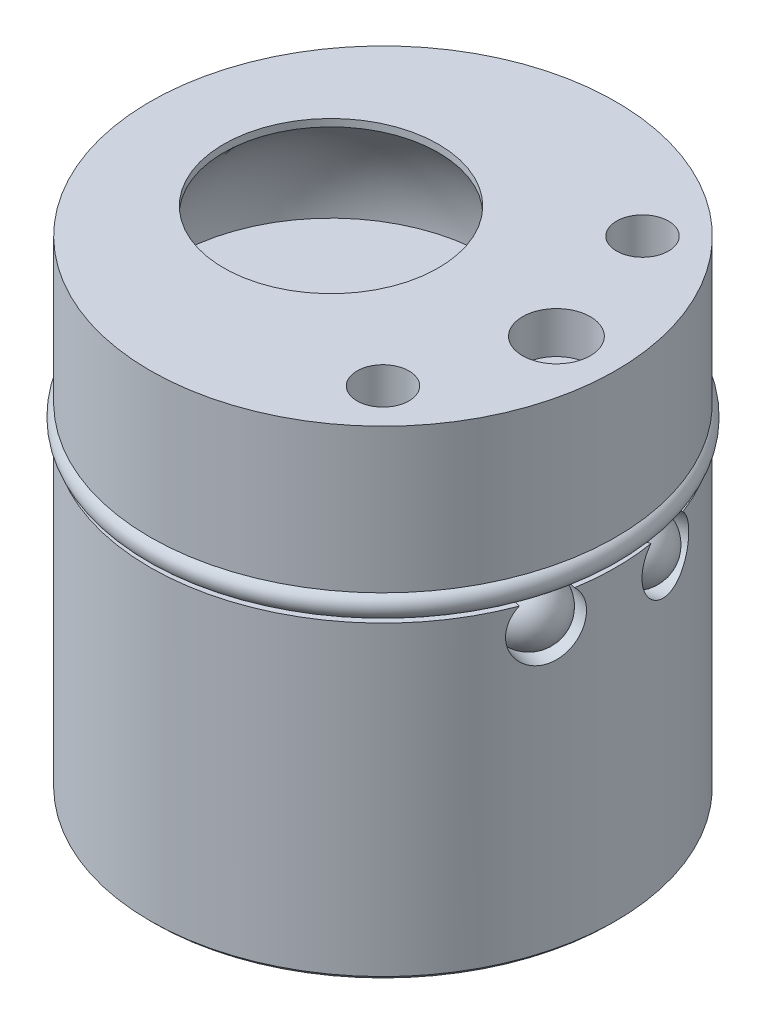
ISO-10303-21;
HEADER;
FILE_DESCRIPTION(('STEP AP214'),'2;1');
FILE_NAME('part.step','',(''),(''),'','','');
FILE_SCHEMA(('AUTOMOTIVE_DESIGN { 1 0 10303 214 1 1 1 1 }'));
ENDSEC;
DATA;
#1=APPLICATION_CONTEXT('core data for automotive mechanical design processes');
#2=APPLICATION_PROTOCOL_DEFINITION('international standard','automotive_design',2000,#1);
#3=PRODUCT_CONTEXT('',#1,'mechanical');
#4=PRODUCT('Part','Part','',(#3));
#5=PRODUCT_RELATED_PRODUCT_CATEGORY('part','',(#4));
#6=PRODUCT_DEFINITION_FORMATION('','',#4);
#7=PRODUCT_DEFINITION_CONTEXT('part definition',#1,'design');
#8=PRODUCT_DEFINITION('design','',#6,#7);
#9=PRODUCT_DEFINITION_SHAPE('','',#8);
#10=(LENGTH_UNIT() NAMED_UNIT(*) SI_UNIT(.MILLI.,.METRE.));
#11=(NAMED_UNIT(*) PLANE_ANGLE_UNIT() SI_UNIT($,.RADIAN.));
#12=(NAMED_UNIT(*) SI_UNIT($,.STERADIAN.) SOLID_ANGLE_UNIT());
#13=UNCERTAINTY_MEASURE_WITH_UNIT(LENGTH_MEASURE(1.E-05),#10,'distance_accuracy_value','');
#14=(GEOMETRIC_REPRESENTATION_CONTEXT(3) GLOBAL_UNCERTAINTY_ASSIGNED_CONTEXT((#13)) GLOBAL_UNIT_ASSIGNED_CONTEXT((#10,
#11,#12)) REPRESENTATION_CONTEXT('',''));
#15=CARTESIAN_POINT('',(0.,0.,0.));
#16=DIRECTION('',(0.,0.,1.));
#17=DIRECTION('',(1.,0.,0.));
#18=AXIS2_PLACEMENT_3D('',#15,#16,#17);
#19=CARTESIAN_POINT('',(0.,19.7993,0.));
#20=DIRECTION('',(0.,1.,0.));
#21=DIRECTION('',(0.,0.,-1.));
#22=AXIS2_PLACEMENT_3D('',#19,#20,#21);
#23=TOROIDAL_SURFACE('',#22,13.7668,0.7493);
#24=CARTESIAN_POINT('',(13.077901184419,19.163021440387,-2.78461597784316));
#25=CARTESIAN_POINT('',(13.0645741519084,19.1708941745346,-2.78642576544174));
#26=CARTESIAN_POINT('',(13.0515562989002,19.1788751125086,-2.79001814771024));
#27=CARTESIAN_POINT('',(13.0264948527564,19.1946580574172,-2.80002700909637));
#28=CARTESIAN_POINT('',(13.0144570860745,19.2024588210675,-2.80645909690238));
#29=CARTESIAN_POINT('',(12.9872721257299,19.2203922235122,-2.82412662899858));
#30=CARTESIAN_POINT('',(12.972594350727,19.2303363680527,-2.83625839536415));
#31=CARTESIAN_POINT('',(12.945030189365,19.2491930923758,-2.8630290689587));
#32=CARTESIAN_POINT('',(12.9321458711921,19.2581044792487,-2.87767082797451));
#33=CARTESIAN_POINT('',(12.9089729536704,19.2740854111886,-2.90719711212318));
#34=CARTESIAN_POINT('',(12.8985543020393,19.2812492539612,-2.92193108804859));
#35=CARTESIAN_POINT('',(12.878700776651,19.2947293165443,-2.95242087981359));
#36=CARTESIAN_POINT('',(12.8692667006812,19.3010448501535,-2.96817750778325));
#37=CARTESIAN_POINT('',(12.8421505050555,19.3187756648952,-3.01663183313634));
#38=CARTESIAN_POINT('',(12.8256873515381,19.3289518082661,-3.05046875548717));
#39=CARTESIAN_POINT('',(12.7968789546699,19.3451858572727,-3.11587005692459));
#40=CARTESIAN_POINT('',(12.7842776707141,19.3515839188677,-3.14724473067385));
#41=CARTESIAN_POINT('',(12.7605312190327,19.3620474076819,-3.21094617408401));
#42=CARTESIAN_POINT('',(12.7493871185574,19.3661111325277,-3.24327362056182));
#43=CARTESIAN_POINT('',(12.7283567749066,19.3719599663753,-3.3085850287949));
#44=CARTESIAN_POINT('',(12.7184724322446,19.3737416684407,-3.34156989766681));
#45=CARTESIAN_POINT('',(12.6999230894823,19.3750409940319,-3.40793962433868));
#46=CARTESIAN_POINT('',(12.6912585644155,19.3745577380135,-3.4413246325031));
#47=CARTESIAN_POINT('',(12.6762674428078,19.371526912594,-3.50398206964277));
#48=CARTESIAN_POINT('',(12.6697834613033,19.3692532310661,-3.53323038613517));
#49=CARTESIAN_POINT('',(12.657950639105,19.362956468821,-3.59176707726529));
#50=CARTESIAN_POINT('',(12.6526015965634,19.3589336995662,-3.62105544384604));
#51=CARTESIAN_POINT('',(12.643307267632,19.3491179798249,-3.67941480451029));
#52=CARTESIAN_POINT('',(12.6393553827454,19.3433335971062,-3.70848616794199));
#53=CARTESIAN_POINT('',(12.6332038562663,19.3299203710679,-3.76640278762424));
#54=CARTESIAN_POINT('',(12.6310041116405,19.3222916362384,-3.7952480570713));
#55=CARTESIAN_POINT('',(12.6292442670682,19.307419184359,-3.84474168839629));
#56=CARTESIAN_POINT('',(12.6291325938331,19.3006256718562,-3.86550429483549));
#57=CARTESIAN_POINT('',(12.6305256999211,19.2859762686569,-3.90658231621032));
#58=CARTESIAN_POINT('',(12.6320286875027,19.2781215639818,-3.92689820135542));
#59=CARTESIAN_POINT('',(12.6371809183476,19.2612216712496,-3.96703114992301));
#60=CARTESIAN_POINT('',(12.6408520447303,19.2521650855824,-3.98684094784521));
#61=CARTESIAN_POINT('',(12.6510520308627,19.2329899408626,-4.02511545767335));
#62=CARTESIAN_POINT('',(12.6575721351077,19.222874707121,-4.04358409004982));
#63=CARTESIAN_POINT('',(12.6758010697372,19.2000899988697,-4.0808489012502));
#64=CARTESIAN_POINT('',(12.6881363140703,19.1872642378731,-4.09928696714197));
#65=CARTESIAN_POINT('',(12.7113853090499,19.1679154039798,-4.12239631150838));
#66=CARTESIAN_POINT('',(12.7200048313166,19.1614005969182,-4.12937451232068));
#67=CARTESIAN_POINT('',(12.7387417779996,19.1486399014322,-4.14126458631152));
#68=CARTESIAN_POINT('',(12.7488567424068,19.1423935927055,-4.14617980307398));
#69=CARTESIAN_POINT('',(12.768758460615,19.1312874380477,-4.15311416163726));
#70=CARTESIAN_POINT('',(12.7783998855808,19.126354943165,-4.15543809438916));
#71=CARTESIAN_POINT('',(12.7982034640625,19.1170478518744,-4.15829200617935));
#72=CARTESIAN_POINT('',(12.8083659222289,19.1126735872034,-4.15882092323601));
#73=CARTESIAN_POINT('',(12.8307677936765,19.1037969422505,-4.1581567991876));
#74=CARTESIAN_POINT('',(12.8430453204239,19.0994190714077,-4.15662902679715));
#75=CARTESIAN_POINT('',(12.8674759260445,19.0914929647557,-4.15160788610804));
#76=CARTESIAN_POINT('',(12.8796285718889,19.0879470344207,-4.14810914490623));
#77=CARTESIAN_POINT('',(12.9093054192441,19.0800539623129,-4.1374705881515));
#78=CARTESIAN_POINT('',(12.9266032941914,19.0761411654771,-4.12938895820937));
#79=CARTESIAN_POINT('',(12.9600515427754,19.06951585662,-4.11076279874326));
#80=CARTESIAN_POINT('',(12.9761991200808,19.0668061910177,-4.10021251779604));
#81=CARTESIAN_POINT('',(13.0184323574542,19.0606160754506,-4.06913034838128));
#82=CARTESIAN_POINT('',(13.043352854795,19.0579735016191,-4.04686133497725));
#83=CARTESIAN_POINT('',(13.0898928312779,19.054095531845,-3.99902900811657));
#84=CARTESIAN_POINT('',(13.1115040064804,19.0528636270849,-3.97345769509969));
#85=CARTESIAN_POINT('',(13.1487164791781,19.0512923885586,-3.92400361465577));
#86=CARTESIAN_POINT('',(13.1647337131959,19.0508477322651,-3.9004333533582));
#87=CARTESIAN_POINT('',(13.1947195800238,19.0502661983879,-3.85201323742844));
#88=CARTESIAN_POINT('',(13.208686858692,19.0501295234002,-3.82716255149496));
#89=CARTESIAN_POINT('',(13.2476851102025,19.049917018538,-3.75106981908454));
#90=CARTESIAN_POINT('',(13.2697969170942,19.0500390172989,-3.69830863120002));
#91=CARTESIAN_POINT('',(13.3074552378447,19.0501567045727,-3.58747618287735));
#92=CARTESIAN_POINT('',(13.3226006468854,19.0501454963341,-3.52927146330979));
#93=CARTESIAN_POINT('',(13.3442170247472,19.0500106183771,-3.41130086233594));
#94=CARTESIAN_POINT('',(13.3507017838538,19.0498871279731,-3.35153761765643));
#95=CARTESIAN_POINT('',(13.3531981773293,19.0503115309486,-3.25357441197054));
#96=CARTESIAN_POINT('',(13.3521615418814,19.050631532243,-3.21543891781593));
#97=CARTESIAN_POINT('',(13.3454357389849,19.0520772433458,-3.13955961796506));
#98=CARTESIAN_POINT('',(13.3397505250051,19.0532022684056,-3.10181550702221));
#99=CARTESIAN_POINT('',(13.3254836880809,19.0564866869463,-3.03980487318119));
#100=CARTESIAN_POINT('',(13.3184528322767,19.05818868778,-3.01515989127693));
#101=CARTESIAN_POINT('',(13.3013238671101,19.0627968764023,-2.96705984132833));
#102=CARTESIAN_POINT('',(13.2912317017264,19.0657007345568,-2.94360256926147));
#103=CARTESIAN_POINT('',(13.2718792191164,19.0719167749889,-2.90739975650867));
#104=CARTESIAN_POINT('',(13.2637472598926,19.0746593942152,-2.89395766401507));
#105=CARTESIAN_POINT('',(13.2458901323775,19.0810802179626,-2.86839384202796));
#106=CARTESIAN_POINT('',(13.2361660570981,19.0847577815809,-2.8562712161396));
#107=CARTESIAN_POINT('',(13.2174997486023,19.0922783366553,-2.83660722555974));
#108=CARTESIAN_POINT('',(13.208898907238,19.0958853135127,-2.8286553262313));
#109=CARTESIAN_POINT('',(13.1907822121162,19.103843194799,-2.81435156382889));
#110=CARTESIAN_POINT('',(13.1812689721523,19.1081920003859,-2.80799530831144));
#111=CARTESIAN_POINT('',(13.161383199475,19.1176906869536,-2.79722556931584));
#112=CARTESIAN_POINT('',(13.1510021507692,19.1228490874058,-2.79283491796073));
#113=CARTESIAN_POINT('',(13.1298560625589,19.1337915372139,-2.78644381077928));
#114=CARTESIAN_POINT('',(13.1190916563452,19.139574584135,-2.78443958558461));
#115=CARTESIAN_POINT('',(13.0981284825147,19.1512370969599,-2.78290182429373));
#116=CARTESIAN_POINT('',(13.0879273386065,19.1570986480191,-2.78325444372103));
#117=CARTESIAN_POINT('',(13.077901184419,19.163021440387,-2.78461597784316));
#118=B_SPLINE_CURVE_WITH_KNOTS('',3,(#24,#25,#26,#27,#28,#29,#30,#31,#32,#33,#34,#35,#36,#37,
#38,#39,#40,#41,#42,#43,#44,#45,#46,#47,#48,#49,#50,#51,#52,#53,#54,#55,#56,#57,#58,#59,#60,#61,
#62,#63,#64,#65,#66,#67,#68,#69,#70,#71,#72,#73,#74,#75,#76,#77,#78,#79,#80,#81,#82,#83,#84,#85,
#86,#87,#88,#89,#90,#91,#92,#93,#94,#95,#96,#97,#98,#99,#100,#101,#102,#103,#104,#105,#106,#107,
#108,#109,#110,#111,#112,#113,#114,#115,#116,#117),.UNSPECIFIED.,.T.,.F.,(4,2,2,2,2,2,2,2,2,2,2,
2,2,2,2,2,2,2,2,2,2,2,2,2,2,2,2,2,2,2,2,2,2,2,2,2,2,2,2,2,2,2,2,2,2,2,4),(0.,0.0466841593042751,
0.0936281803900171,0.157711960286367,0.221869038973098,0.280030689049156,0.338239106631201,
0.454835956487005,0.557949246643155,0.661137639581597,0.764479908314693,0.86786231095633,
0.957929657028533,1.04798097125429,1.13760112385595,1.22721600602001,1.29268232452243,
1.35807607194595,1.42414140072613,1.49000510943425,1.56564291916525,1.60401273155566,
1.64232011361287,1.67537239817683,1.70844423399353,1.74760101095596,1.78686505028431,
1.84500512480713,1.90328202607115,2.00329702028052,2.10355900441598,2.18894312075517,
2.27438338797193,2.44534277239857,2.62519048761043,2.8047514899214,2.91899231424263,
3.03313608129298,3.11002861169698,3.18677278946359,3.23449877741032,3.28219213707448,
3.31882843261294,3.35536274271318,3.39231106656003,3.42920095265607,3.46432224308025),.UNSPECIFIED.);
#119=CARTESIAN_POINT('',(13.077901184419,19.163021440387,-2.78461597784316));
#120=VERTEX_POINT('',#119);
#121=EDGE_CURVE('E21',#120,#120,#118,.T.);
#122=ORIENTED_EDGE('',*,*,#121,.F.);
#123=EDGE_LOOP('',(#122));
#124=FACE_BOUND('',#123,.T.);
#125=CARTESIAN_POINT('',(12.7181026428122,19.1630214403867,4.12740241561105));
#126=CARTESIAN_POINT('',(12.7074659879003,19.1708941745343,4.11917157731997));
#127=CARTESIAN_POINT('',(12.6979883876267,19.1788751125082,4.10955155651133));
#128=CARTESIAN_POINT('',(12.6812889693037,19.1946580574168,4.08835290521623));
#129=CARTESIAN_POINT('',(12.6740800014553,19.2024588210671,4.07676367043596));
#130=CARTESIAN_POINT('',(12.6593709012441,19.2203922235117,4.04787065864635));
#131=CARTESIAN_POINT('',(12.6527254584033,19.2303363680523,4.03002535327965));
#132=CARTESIAN_POINT('',(12.642239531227,19.2491930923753,3.99305918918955));
#133=CARTESIAN_POINT('',(12.6384022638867,19.2581044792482,3.97393689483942));
#134=CARTESIAN_POINT('',(12.6330970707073,19.2740854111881,3.9367799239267));
#135=CARTESIAN_POINT('',(12.6314412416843,19.2812492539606,3.91881060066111));
#136=CARTESIAN_POINT('',(12.6294924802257,19.2947293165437,3.88247890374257));
#137=CARTESIAN_POINT('',(12.6292006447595,19.3010448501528,3.86411622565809));
#138=CARTESIAN_POINT('',(12.6299444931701,19.3187756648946,3.80859545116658));
#139=CARTESIAN_POINT('',(12.6326054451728,19.3289518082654,3.77106024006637));
#140=CARTESIAN_POINT('',(12.6403572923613,19.3451858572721,3.70001685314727));
#141=CARTESIAN_POINT('',(12.6451315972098,19.3515839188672,3.66654494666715));
#142=CARTESIAN_POINT('',(12.6564172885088,19.3620474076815,3.59950465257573));
#143=CARTESIAN_POINT('',(12.6629299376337,19.3661111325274,3.56593621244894));
#144=CARTESIAN_POINT('',(12.6773728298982,19.3719599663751,3.49885970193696));
#145=CARTESIAN_POINT('',(12.6853051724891,19.3737416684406,3.46535179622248));
#146=CARTESIAN_POINT('',(12.7024258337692,19.3750409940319,3.39859925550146));
#147=CARTESIAN_POINT('',(12.7116146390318,19.3745577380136,3.36535472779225));
#148=CARTESIAN_POINT('',(12.729960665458,19.3715269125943,3.30359623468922));
#149=CARTESIAN_POINT('',(12.7389695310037,19.3692532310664,3.2750244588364));
#150=CARTESIAN_POINT('',(12.7579903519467,19.3629564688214,3.2184137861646));
#151=CARTESIAN_POINT('',(12.7680021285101,19.3589336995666,3.19037479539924));
#152=CARTESIAN_POINT('',(12.7891326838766,19.3491179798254,3.13518694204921));
#153=CARTESIAN_POINT('',(12.8002459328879,19.3433335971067,3.10803446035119));
#154=CARTESIAN_POINT('',(12.8238768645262,19.3299203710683,3.05480143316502));
#155=CARTESIAN_POINT('',(12.836394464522,19.3222916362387,3.02872082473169));
#156=CARTESIAN_POINT('',(12.8596172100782,19.3074191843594,2.9849781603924));
#157=CARTESIAN_POINT('',(12.8699018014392,19.3006256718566,2.96694137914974));
#158=CARTESIAN_POINT('',(12.8916472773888,19.2859762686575,2.93206332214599));
#159=CARTESIAN_POINT('',(12.9031068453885,19.2781215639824,2.91522074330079));
#160=CARTESIAN_POINT('',(12.9276352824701,19.2612216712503,2.883040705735));
#161=CARTESIAN_POINT('',(12.940719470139,19.2521650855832,2.86772048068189));
#162=CARTESIAN_POINT('',(12.9686901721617,19.2329899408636,2.83967377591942));
#163=CARTESIAN_POINT('',(12.9835710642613,19.222874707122,2.82693952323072));
#164=CARTESIAN_POINT('',(13.0179901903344,19.2000899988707,2.80378171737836));
#165=CARTESIAN_POINT('',(13.0378918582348,19.187264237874,2.79398150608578));
#166=CARTESIAN_POINT('',(13.0695807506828,19.1679154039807,2.7855927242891));
#167=CARTESIAN_POINT('',(13.0805345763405,19.161400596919,2.78385918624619));
#168=CARTESIAN_POINT('',(13.1027062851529,19.1486399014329,2.78293055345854));
#169=CARTESIAN_POINT('',(13.1139237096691,19.1423935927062,2.78373133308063));
#170=CARTESIAN_POINT('',(13.1346262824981,19.1312874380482,2.78767686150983));
#171=CARTESIAN_POINT('',(13.1441379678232,19.1263549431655,2.79048498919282));
#172=CARTESIAN_POINT('',(13.1627153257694,19.1170478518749,2.79791521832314));
#173=CARTESIAN_POINT('',(13.1717807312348,19.1126735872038,2.80253839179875));
#174=CARTESIAN_POINT('',(13.1908492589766,19.1037969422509,2.81431447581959));
#175=CARTESIAN_POINT('',(13.2007180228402,19.0994190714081,2.82177632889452));
#176=CARTESIAN_POINT('',(13.2193649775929,19.0914929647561,2.83834006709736));
#177=CARTESIAN_POINT('',(13.2281401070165,19.0879470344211,2.84744638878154));
#178=CARTESIAN_POINT('',(13.2485217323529,19.0800539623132,2.87149807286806));
#179=CARTESIAN_POINT('',(13.2594613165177,19.0761411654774,2.8871459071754));
#180=CARTESIAN_POINT('',(13.2791152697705,19.0695158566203,2.92000075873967));
#181=CARTESIAN_POINT('',(13.2878243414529,19.066806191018,2.93721135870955));
#182=CARTESIAN_POINT('',(13.308858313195,19.0606160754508,2.98524592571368));
#183=CARTESIAN_POINT('',(13.3193055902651,19.0579735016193,3.01699170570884));
#184=CARTESIAN_POINT('',(13.3356942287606,19.0540955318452,3.0816857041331));
#185=CARTESIAN_POINT('',(13.3416243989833,19.0528636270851,3.11463669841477));
#186=CARTESIAN_POINT('',(13.3491243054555,19.0512923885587,3.17607142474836));
#187=CARTESIAN_POINT('',(13.3512105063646,19.0508477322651,3.20449248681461));
#188=CARTESIAN_POINT('',(13.3529689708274,19.050266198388,3.26141847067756));
#189=CARTESIAN_POINT('',(13.3526396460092,19.0501295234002,3.28992343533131));
#190=CARTESIAN_POINT('',(13.3483667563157,19.049917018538,3.37532080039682));
#191=CARTESIAN_POINT('',(13.3411355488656,19.0500390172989,3.43206923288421));
#192=CARTESIAN_POINT('',(13.3183323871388,19.0501567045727,3.54688210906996));
#193=CARTESIAN_POINT('',(13.3023463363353,19.0501454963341,3.6048615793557));
#194=CARTESIAN_POINT('',(13.2620813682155,19.0500106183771,3.71783530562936));
#195=CARTESIAN_POINT('',(13.2378157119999,19.0498871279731,3.77283417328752));
#196=CARTESIAN_POINT('',(13.190996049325,19.0503115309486,3.85892099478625));
#197=CARTESIAN_POINT('',(13.1710305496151,19.0506315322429,3.89142898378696));
#198=CARTESIAN_POINT('',(13.1272661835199,19.0520772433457,3.9537794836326));
#199=CARTESIAN_POINT('',(13.1034705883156,19.0532022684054,3.98362423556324));
#200=CARTESIAN_POINT('',(13.0601098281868,19.0564866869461,4.03019360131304));
#201=CARTESIAN_POINT('',(13.0416984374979,19.0581886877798,4.0480213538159));
#202=CARTESIAN_POINT('',(13.0028142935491,19.062796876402,4.08111273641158));
#203=CARTESIAN_POINT('',(12.9823455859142,19.0657007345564,4.09638124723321));
#204=CARTESIAN_POINT('',(12.9474844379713,19.0719167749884,4.118057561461));
#205=CARTESIAN_POINT('',(12.9337209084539,19.0746593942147,4.12563277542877));
#206=CARTESIAN_POINT('',(12.9054742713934,19.0810802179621,4.13884313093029));
#207=CARTESIAN_POINT('',(12.8909916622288,19.0847577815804,4.1444795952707));
#208=CARTESIAN_POINT('',(12.8649941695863,19.0922783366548,4.15217595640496));
#209=CARTESIAN_POINT('',(12.8535696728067,19.0958853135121,4.15476208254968));
#210=CARTESIAN_POINT('',(12.8307282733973,19.1038431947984,4.15809115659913));
#211=CARTESIAN_POINT('',(12.8193114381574,19.1081920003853,4.1588392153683));
#212=CARTESIAN_POINT('',(12.7967049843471,19.117690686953,4.15822319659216));
#213=CARTESIAN_POINT('',(12.7855194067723,19.1228490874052,4.15683508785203));
#214=CARTESIAN_POINT('',(12.7640108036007,19.1337915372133,4.15179690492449));
#215=CARTESIAN_POINT('',(12.7536864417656,19.1395745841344,4.14815041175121));
#216=CARTESIAN_POINT('',(12.7347629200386,19.1512370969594,4.13900056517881));
#217=CARTESIAN_POINT('',(12.72610477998,19.1570986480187,4.13359461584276));
#218=CARTESIAN_POINT('',(12.7181026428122,19.1630214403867,4.12740241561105));
#219=B_SPLINE_CURVE_WITH_KNOTS('',3,(#125,#126,#127,#128,#129,#130,#131,#132,#133,#134,#135,
#136,#137,#138,#139,#140,#141,#142,#143,#144,#145,#146,#147,#148,#149,#150,#151,#152,#153,#154,
#155,#156,#157,#158,#159,#160,#161,#162,#163,#164,#165,#166,#167,#168,#169,#170,#171,#172,#173,
#174,#175,#176,#177,#178,#179,#180,#181,#182,#183,#184,#185,#186,#187,#188,#189,#190,#191,#192,
#193,#194,#195,#196,#197,#198,#199,#200,#201,#202,#203,#204,#205,#206,#207,#208,#209,#210,#211,
#212,#213,#214,#215,#216,#217,#218),.UNSPECIFIED.,.T.,.F.,(4,2,2,2,2,2,2,2,2,2,2,2,2,2,2,2,2,2,
2,2,2,2,2,2,2,2,2,2,2,2,2,2,2,2,2,2,2,2,2,2,2,2,2,2,2,2,4),(0.,0.046684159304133,
0.093628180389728,0.157711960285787,0.22186903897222,0.280030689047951,0.33823910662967,
0.454835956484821,0.55794924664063,0.661137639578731,0.764479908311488,0.867862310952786,
0.957929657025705,1.04798097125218,1.13760112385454,1.22721600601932,1.29268232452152,
1.35807607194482,1.42414140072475,1.49000510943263,1.56564291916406,1.60401273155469,
1.64232011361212,1.67537239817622,1.70844423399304,1.74760101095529,1.78686505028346,
1.84500512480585,1.90328202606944,2.00329702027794,2.10355900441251,2.18894312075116,
2.27438338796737,2.44534277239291,2.62519048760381,2.80475148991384,2.91899231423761,
3.03313608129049,3.11002861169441,3.18677278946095,3.23449877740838,3.28219213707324,
3.31882843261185,3.35536274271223,3.39231106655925,3.42920095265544,3.46432224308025),.UNSPECIFIED.);
#220=CARTESIAN_POINT('',(12.7181026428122,19.1630214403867,4.12740241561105));
#221=VERTEX_POINT('',#220);
#222=EDGE_CURVE('E61',#221,#221,#219,.T.);
#223=ORIENTED_EDGE('',*,*,#222,.F.);
#224=EDGE_LOOP('',(#223));
#225=FACE_BOUND('',#224,.T.);
#226=ADVANCED_FACE('F16',(#124,#225),#23,.T.);
#227=CARTESIAN_POINT('',(12.1445854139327,17.4752,-3.25413185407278));
#228=DIRECTION('',(-0.258819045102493,0.,-0.965925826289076));
#229=DIRECTION('',(-0.965925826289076,0.,0.258819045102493));
#230=AXIS2_PLACEMENT_3D('',#227,#228,#229);
#231=SPHERICAL_SURFACE('',#230,1.98501);
#232=ORIENTED_EDGE('',*,*,#121,.T.);
#233=EDGE_LOOP('',(#232));
#234=FACE_BOUND('',#233,.T.);
#235=CARTESIAN_POINT('',(12.1445854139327,19.46021,-3.25413185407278));
#236=CARTESIAN_POINT('',(12.1590398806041,19.4602096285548,-3.20018705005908));
#237=CARTESIAN_POINT('',(12.1734874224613,19.4578516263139,-3.14626808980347));
#238=CARTESIAN_POINT('',(12.2022791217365,19.4484445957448,-3.03881600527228));
#239=CARTESIAN_POINT('',(12.2166232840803,19.4413957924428,-2.98528286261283));
#240=CARTESIAN_POINT('',(12.259321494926,19.4132801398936,-2.82593097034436));
#241=CARTESIAN_POINT('',(12.2873895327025,19.3852438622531,-2.7211796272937));
#242=CARTESIAN_POINT('',(12.3419081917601,19.3113635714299,-2.51771322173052));
#243=CARTESIAN_POINT('',(12.3683580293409,19.2655110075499,-2.41900108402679));
#244=CARTESIAN_POINT('',(12.4188891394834,19.1573045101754,-2.23041641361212));
#245=CARTESIAN_POINT('',(12.4429708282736,19.0949534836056,-2.14054232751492));
#246=CARTESIAN_POINT('',(12.4880821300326,18.9555190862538,-1.97218465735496));
#247=CARTESIAN_POINT('',(12.5091117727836,18.8784358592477,-1.89370096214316));
#248=CARTESIAN_POINT('',(12.5475276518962,18.7117040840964,-1.75033094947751));
#249=CARTESIAN_POINT('',(12.5649131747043,18.6220530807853,-1.68544729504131));
#250=CARTESIAN_POINT('',(12.5955441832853,18.4327374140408,-1.57113081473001));
#251=CARTESIAN_POINT('',(12.6087888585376,18.3330707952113,-1.5217010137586));
#252=CARTESIAN_POINT('',(12.6307526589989,18.1265804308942,-1.43973099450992));
#253=CARTESIAN_POINT('',(12.6394744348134,18.0197609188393,-1.40718088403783));
#254=CARTESIAN_POINT('',(12.6499773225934,17.83943977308,-1.36798357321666));
#255=CARTESIAN_POINT('',(12.6531128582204,17.7670724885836,-1.35628159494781));
#256=CARTESIAN_POINT('',(12.6572958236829,17.6215469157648,-1.34067055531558));
#257=CARTESIAN_POINT('',(12.6583462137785,17.548389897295,-1.33675044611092));
#258=CARTESIAN_POINT('',(12.6583438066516,17.4752,-1.3367594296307));
#259=B_SPLINE_CURVE_WITH_KNOTS('',3,(#235,#236,#237,#238,#239,#240,#241,#242,#243,#244,#245,
#246,#247,#248,#249,#250,#251,#252,#253,#254,#255,#256,#257,#258),.UNSPECIFIED.,.F.,.F.,(4,2,2,
2,2,2,2,2,2,2,2,4),(0.,0.167440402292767,0.334872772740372,0.669185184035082,1.00365824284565,
1.33807240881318,1.67248331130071,2.00695963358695,2.34150138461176,2.67584685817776,
2.89555223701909,3.11494547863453),.UNSPECIFIED.);
#260=CARTESIAN_POINT('',(12.1445854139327,19.46021,-3.25413185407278));
#261=VERTEX_POINT('',#260);
#262=CARTESIAN_POINT('',(12.6583438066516,17.4752,-1.3367594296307));
#263=VERTEX_POINT('',#262);
#264=EDGE_CURVE('E72',#261,#263,#259,.T.);
#265=ORIENTED_EDGE('',*,*,#264,.T.);
#266=CARTESIAN_POINT('',(12.1445854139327,17.4752,-3.25413185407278));
#267=DIRECTION('',(-0.965925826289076,0.,0.258819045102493));
#268=DIRECTION('',(-0.258819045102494,0.,-0.965925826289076));
#269=AXIS2_PLACEMENT_3D('',#266,#267,#268);
#270=CIRCLE('',#269,1.98501);
#271=CARTESIAN_POINT('',(12.1445854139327,15.49019,-3.25413185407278));
#272=VERTEX_POINT('',#271);
#273=EDGE_CURVE('E241',#263,#272,#270,.F.);
#274=ORIENTED_EDGE('',*,*,#273,.T.);
#275=CARTESIAN_POINT('',(12.1445854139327,15.49019,-3.25413185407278));
#276=CARTESIAN_POINT('',(12.1301309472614,15.4901903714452,-3.30807665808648));
#277=CARTESIAN_POINT('',(12.1156834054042,15.492548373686,-3.36199561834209));
#278=CARTESIAN_POINT('',(12.086891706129,15.5019554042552,-3.46944770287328));
#279=CARTESIAN_POINT('',(12.0725475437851,15.5090042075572,-3.52298084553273));
#280=CARTESIAN_POINT('',(12.0298493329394,15.5371198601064,-3.68233273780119));
#281=CARTESIAN_POINT('',(12.0017812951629,15.5651561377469,-3.78708408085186));
#282=CARTESIAN_POINT('',(11.9472626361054,15.6390364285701,-3.99055048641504));
#283=CARTESIAN_POINT('',(11.9208127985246,15.6848889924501,-4.08926262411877));
#284=CARTESIAN_POINT('',(11.8702816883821,15.7930954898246,-4.27784729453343));
#285=CARTESIAN_POINT('',(11.8461999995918,15.8554465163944,-4.36772138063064));
#286=CARTESIAN_POINT('',(11.8010886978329,15.9948809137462,-4.5360790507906));
#287=CARTESIAN_POINT('',(11.7800590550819,16.0719641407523,-4.6145627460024));
#288=CARTESIAN_POINT('',(11.7416431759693,16.2386959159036,-4.75793275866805));
#289=CARTESIAN_POINT('',(11.7242576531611,16.3283469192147,-4.82281641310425));
#290=CARTESIAN_POINT('',(11.6936266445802,16.5176625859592,-4.93713289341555));
#291=CARTESIAN_POINT('',(11.6803819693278,16.6173292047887,-4.98656269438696));
#292=CARTESIAN_POINT('',(11.6584181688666,16.8238195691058,-5.06853271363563));
#293=CARTESIAN_POINT('',(11.6496963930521,16.9306390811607,-5.10108282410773));
#294=CARTESIAN_POINT('',(11.639193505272,17.11096022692,-5.1402801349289));
#295=CARTESIAN_POINT('',(11.6360579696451,17.1833275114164,-5.15198211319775));
#296=CARTESIAN_POINT('',(11.6318750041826,17.3288530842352,-5.16759315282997));
#297=CARTESIAN_POINT('',(11.630824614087,17.402010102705,-5.17151326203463));
#298=CARTESIAN_POINT('',(11.6308270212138,17.4752,-5.17150427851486));
#299=B_SPLINE_CURVE_WITH_KNOTS('',3,(#275,#276,#277,#278,#279,#280,#281,#282,#283,#284,#285,
#286,#287,#288,#289,#290,#291,#292,#293,#294,#295,#296,#297,#298),.UNSPECIFIED.,.F.,.F.,(4,2,2,
2,2,2,2,2,2,2,2,4),(0.,0.167440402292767,0.334872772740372,0.669185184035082,1.00365824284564,
1.33807240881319,1.67248331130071,2.00695963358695,2.34150138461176,2.67584685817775,
2.89555223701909,3.11494547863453),.UNSPECIFIED.);
#300=CARTESIAN_POINT('',(11.6308270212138,17.4752,-5.17150427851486));
#301=VERTEX_POINT('',#300);
#302=EDGE_CURVE('E236',#272,#301,#299,.T.);
#303=ORIENTED_EDGE('',*,*,#302,.T.);
#304=CARTESIAN_POINT('',(12.1445854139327,17.4752,-3.25413185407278));
#305=DIRECTION('',(0.965925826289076,0.,-0.258819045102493));
#306=DIRECTION('',(-0.258819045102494,0.,-0.965925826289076));
#307=AXIS2_PLACEMENT_3D('',#304,#305,#306);
#308=CIRCLE('',#307,1.98501);
#309=EDGE_CURVE('E234',#301,#261,#308,.T.);
#310=ORIENTED_EDGE('',*,*,#309,.T.);
#311=EDGE_LOOP('',(#265,#274,#303,#310));
#312=FACE_BOUND('',#311,.T.);
#313=ADVANCED_FACE('F177',(#234,#312),#231,.T.);
#314=CARTESIAN_POINT('',(12.1445854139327,17.4752,-3.25413185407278));
#315=DIRECTION('',(-0.965925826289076,0.,0.258819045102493));
#316=DIRECTION('',(0.258819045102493,0.,0.965925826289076));
#317=AXIS2_PLACEMENT_3D('',#314,#315,#316);
#318=PLANE('',#317);
#319=ORIENTED_EDGE('',*,*,#264,.F.);
#320=ORIENTED_EDGE('',*,*,#309,.F.);
#321=ORIENTED_EDGE('',*,*,#302,.F.);
#322=ORIENTED_EDGE('',*,*,#273,.F.);
#323=EDGE_LOOP('',(#319,#320,#321,#322));
#324=FACE_BOUND('',#323,.T.);
#325=CARTESIAN_POINT('',(12.1445854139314,17.4752,-3.25413185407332));
#326=DIRECTION('',(-0.965925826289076,0.,0.258819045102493));
#327=DIRECTION('',(0.258819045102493,0.,0.965925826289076));
#328=AXIS2_PLACEMENT_3D('',#325,#326,#327);
#329=CIRCLE('',#328,2.0193);
#330=CARTESIAN_POINT('',(12.6672187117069,17.4752,-1.30363783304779));
#331=VERTEX_POINT('',#330);
#332=EDGE_CURVE('E231',#331,#331,#329,.F.);
#333=ORIENTED_EDGE('',*,*,#332,.T.);
#334=EDGE_LOOP('',(#333));
#335=FACE_BOUND('',#334,.T.);
#336=ADVANCED_FACE('F243',(#324,#335),#318,.F.);
#337=CARTESIAN_POINT('',(12.1445854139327,17.4752,3.25413185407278));
#338=DIRECTION('',(0.258819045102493,0.,-0.965925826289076));
#339=DIRECTION('',(-0.965925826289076,0.,-0.258819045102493));
#340=AXIS2_PLACEMENT_3D('',#337,#338,#339);
#341=SPHERICAL_SURFACE('',#340,1.98501);
#342=ORIENTED_EDGE('',*,*,#222,.T.);
#343=EDGE_LOOP('',(#342));
#344=FACE_BOUND('',#343,.T.);
#345=CARTESIAN_POINT('',(12.1445854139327,19.46021,3.25413185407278));
#346=CARTESIAN_POINT('',(12.1301309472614,19.4602096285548,3.30807665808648));
#347=CARTESIAN_POINT('',(12.1156834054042,19.4578516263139,3.36199561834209));
#348=CARTESIAN_POINT('',(12.086891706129,19.4484445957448,3.46944770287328));
#349=CARTESIAN_POINT('',(12.0725475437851,19.4413957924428,3.52298084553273));
#350=CARTESIAN_POINT('',(12.0298493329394,19.4132801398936,3.68233273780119));
#351=CARTESIAN_POINT('',(12.0017812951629,19.3852438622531,3.78708408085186));
#352=CARTESIAN_POINT('',(11.9472626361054,19.3113635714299,3.99055048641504));
#353=CARTESIAN_POINT('',(11.9208127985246,19.2655110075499,4.08926262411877));
#354=CARTESIAN_POINT('',(11.8702816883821,19.1573045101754,4.27784729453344));
#355=CARTESIAN_POINT('',(11.8461999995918,19.0949534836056,4.36772138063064));
#356=CARTESIAN_POINT('',(11.8010886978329,18.9555190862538,4.5360790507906));
#357=CARTESIAN_POINT('',(11.7800590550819,18.8784358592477,4.61456274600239));
#358=CARTESIAN_POINT('',(11.7416431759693,18.7117040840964,4.75793275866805));
#359=CARTESIAN_POINT('',(11.7242576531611,18.6220530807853,4.82281641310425));
#360=CARTESIAN_POINT('',(11.6936266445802,18.4327374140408,4.93713289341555));
#361=CARTESIAN_POINT('',(11.6803819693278,18.3330707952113,4.98656269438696));
#362=CARTESIAN_POINT('',(11.6584181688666,18.1265804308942,5.06853271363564));
#363=CARTESIAN_POINT('',(11.6496963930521,18.0197609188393,5.10108282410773));
#364=CARTESIAN_POINT('',(11.639193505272,17.83943977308,5.1402801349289));
#365=CARTESIAN_POINT('',(11.6360579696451,17.7670724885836,5.15198211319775));
#366=CARTESIAN_POINT('',(11.6318750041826,17.6215469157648,5.16759315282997));
#367=CARTESIAN_POINT('',(11.630824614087,17.548389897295,5.17151326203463));
#368=CARTESIAN_POINT('',(11.6308270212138,17.4752,5.17150427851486));
#369=B_SPLINE_CURVE_WITH_KNOTS('',3,(#345,#346,#347,#348,#349,#350,#351,#352,#353,#354,#355,
#356,#357,#358,#359,#360,#361,#362,#363,#364,#365,#366,#367,#368),.UNSPECIFIED.,.F.,.F.,(4,2,2,
2,2,2,2,2,2,2,2,4),(0.,0.167440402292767,0.334872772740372,0.669185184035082,1.00365824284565,
1.33807240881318,1.67248331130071,2.00695963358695,2.34150138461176,2.67584685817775,
2.89555223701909,3.11494547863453),.UNSPECIFIED.);
#370=CARTESIAN_POINT('',(12.1445854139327,19.46021,3.25413185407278));
#371=VERTEX_POINT('',#370);
#372=CARTESIAN_POINT('',(11.6308270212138,17.4752,5.17150427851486));
#373=VERTEX_POINT('',#372);
#374=EDGE_CURVE('E226',#371,#373,#369,.T.);
#375=ORIENTED_EDGE('',*,*,#374,.T.);
#376=CARTESIAN_POINT('',(12.1445854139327,17.4752,3.25413185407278));
#377=DIRECTION('',(-0.965925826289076,0.,-0.258819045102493));
#378=DIRECTION('',(0.258819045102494,0.,-0.965925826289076));
#379=AXIS2_PLACEMENT_3D('',#376,#377,#378);
#380=CIRCLE('',#379,1.98501);
#381=CARTESIAN_POINT('',(12.1445854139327,15.49019,3.25413185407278));
#382=VERTEX_POINT('',#381);
#383=EDGE_CURVE('E216',#373,#382,#380,.F.);
#384=ORIENTED_EDGE('',*,*,#383,.T.);
#385=CARTESIAN_POINT('',(12.1445854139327,15.49019,3.25413185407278));
#386=CARTESIAN_POINT('',(12.1590398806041,15.4901903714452,3.20018705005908));
#387=CARTESIAN_POINT('',(12.1734874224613,15.492548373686,3.14626808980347));
#388=CARTESIAN_POINT('',(12.2022791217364,15.5019554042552,3.03881600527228));
#389=CARTESIAN_POINT('',(12.2166232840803,15.5090042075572,2.98528286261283));
#390=CARTESIAN_POINT('',(12.259321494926,15.5371198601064,2.82593097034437));
#391=CARTESIAN_POINT('',(12.2873895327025,15.5651561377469,2.7211796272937));
#392=CARTESIAN_POINT('',(12.3419081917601,15.6390364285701,2.51771322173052));
#393=CARTESIAN_POINT('',(12.3683580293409,15.6848889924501,2.41900108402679));
#394=CARTESIAN_POINT('',(12.4188891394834,15.7930954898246,2.23041641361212));
#395=CARTESIAN_POINT('',(12.4429708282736,15.8554465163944,2.14054232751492));
#396=CARTESIAN_POINT('',(12.4880821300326,15.9948809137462,1.97218465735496));
#397=CARTESIAN_POINT('',(12.5091117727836,16.0719641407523,1.89370096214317));
#398=CARTESIAN_POINT('',(12.5475276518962,16.2386959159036,1.75033094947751));
#399=CARTESIAN_POINT('',(12.5649131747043,16.3283469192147,1.68544729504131));
#400=CARTESIAN_POINT('',(12.5955441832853,16.5176625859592,1.57113081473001));
#401=CARTESIAN_POINT('',(12.6087888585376,16.6173292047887,1.5217010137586));
#402=CARTESIAN_POINT('',(12.6307526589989,16.8238195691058,1.43973099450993));
#403=CARTESIAN_POINT('',(12.6394744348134,16.9306390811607,1.40718088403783));
#404=CARTESIAN_POINT('',(12.6499773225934,17.11096022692,1.36798357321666));
#405=CARTESIAN_POINT('',(12.6531128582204,17.1833275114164,1.35628159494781));
#406=CARTESIAN_POINT('',(12.6572958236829,17.3288530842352,1.34067055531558));
#407=CARTESIAN_POINT('',(12.6583462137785,17.402010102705,1.33675044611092));
#408=CARTESIAN_POINT('',(12.6583438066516,17.4752,1.3367594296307));
#409=B_SPLINE_CURVE_WITH_KNOTS('',3,(#385,#386,#387,#388,#389,#390,#391,#392,#393,#394,#395,
#396,#397,#398,#399,#400,#401,#402,#403,#404,#405,#406,#407,#408),.UNSPECIFIED.,.F.,.F.,(4,2,2,
2,2,2,2,2,2,2,2,4),(0.,0.167440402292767,0.334872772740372,0.669185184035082,1.00365824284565,
1.33807240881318,1.67248331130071,2.00695963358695,2.34150138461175,2.67584685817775,
2.89555223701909,3.11494547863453),.UNSPECIFIED.);
#410=CARTESIAN_POINT('',(12.6583438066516,17.4752,1.3367594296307));
#411=VERTEX_POINT('',#410);
#412=EDGE_CURVE('E210',#382,#411,#409,.T.);
#413=ORIENTED_EDGE('',*,*,#412,.T.);
#414=CARTESIAN_POINT('',(12.1445854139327,17.4752,3.25413185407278));
#415=DIRECTION('',(0.965925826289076,0.,0.258819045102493));
#416=DIRECTION('',(0.258819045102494,0.,-0.965925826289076));
#417=AXIS2_PLACEMENT_3D('',#414,#415,#416);
#418=CIRCLE('',#417,1.98501);
#419=EDGE_CURVE('E207',#411,#371,#418,.T.);
#420=ORIENTED_EDGE('',*,*,#419,.T.);
#421=EDGE_LOOP('',(#375,#384,#413,#420));
#422=FACE_BOUND('',#421,.T.);
#423=ADVANCED_FACE('F218',(#344,#422),#341,.T.);
#424=CARTESIAN_POINT('',(12.1445854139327,17.4752,3.25413185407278));
#425=DIRECTION('',(-0.965925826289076,0.,-0.258819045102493));
#426=DIRECTION('',(-0.258819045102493,0.,0.965925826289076));
#427=AXIS2_PLACEMENT_3D('',#424,#425,#426);
#428=PLANE('',#427);
#429=ORIENTED_EDGE('',*,*,#374,.F.);
#430=ORIENTED_EDGE('',*,*,#419,.F.);
#431=ORIENTED_EDGE('',*,*,#412,.F.);
#432=ORIENTED_EDGE('',*,*,#383,.F.);
#433=EDGE_LOOP('',(#429,#430,#431,#432));
#434=FACE_BOUND('',#433,.T.);
#435=CARTESIAN_POINT('',(12.1445854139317,17.4752,3.2541318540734));
#436=DIRECTION('',(-0.965925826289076,0.,-0.258819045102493));
#437=DIRECTION('',(-0.258819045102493,0.,0.965925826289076));
#438=AXIS2_PLACEMENT_3D('',#435,#436,#437);
#439=CIRCLE('',#438,2.0193);
#440=CARTESIAN_POINT('',(11.6219521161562,17.4752,5.20462587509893));
#441=VERTEX_POINT('',#440);
#442=EDGE_CURVE('E204',#441,#441,#439,.F.);
#443=ORIENTED_EDGE('',*,*,#442,.T.);
#444=EDGE_LOOP('',(#443));
#445=FACE_BOUND('',#444,.T.);
#446=ADVANCED_FACE('F221',(#434,#445),#428,.F.);
#447=CARTESIAN_POINT('',(13.7393289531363,17.4752,-3.68144209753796));
#448=DIRECTION('',(-0.965925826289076,0.,0.258819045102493));
#449=DIRECTION('',(0.258819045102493,0.,0.965925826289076));
#450=AXIS2_PLACEMENT_3D('',#447,#448,#449);
#451=CYLINDRICAL_SURFACE('',#450,2.0193);
#452=ORIENTED_EDGE('',*,*,#332,.F.);
#453=EDGE_LOOP('',(#452));
#454=FACE_BOUND('',#453,.T.);
#455=CARTESIAN_POINT('',(13.3169786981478,18.9483999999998,-4.99802504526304));
#456=CARTESIAN_POINT('',(13.302375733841,18.9096232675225,-5.03693420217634));
#457=CARTESIAN_POINT('',(13.2881797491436,18.8691250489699,-5.07424002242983));
#458=CARTESIAN_POINT('',(13.2607683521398,18.7849311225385,-5.14544973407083));
#459=CARTESIAN_POINT('',(13.2475529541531,18.7412353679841,-5.17935357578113));
#460=CARTESIAN_POINT('',(13.2096135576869,18.6056695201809,-5.27570477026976));
#461=CARTESIAN_POINT('',(13.1866136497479,18.5093663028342,-5.33274629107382));
#462=CARTESIAN_POINT('',(13.1465290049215,18.3077650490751,-5.43081733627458));
#463=CARTESIAN_POINT('',(13.1294492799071,18.2024594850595,-5.47183329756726));
#464=CARTESIAN_POINT('',(13.1022397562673,17.9860377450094,-5.53667224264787));
#465=CARTESIAN_POINT('',(13.0920922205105,17.8749371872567,-5.56053911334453));
#466=CARTESIAN_POINT('',(13.0829832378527,17.7150002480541,-5.58191365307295));
#467=CARTESIAN_POINT('',(13.0809456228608,17.6672002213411,-5.58668506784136));
#468=CARTESIAN_POINT('',(13.0782235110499,17.5713411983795,-5.59305438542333));
#469=CARTESIAN_POINT('',(13.0775392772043,17.5232821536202,-5.59465167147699));
#470=CARTESIAN_POINT('',(13.0775440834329,17.3624664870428,-5.59464495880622));
#471=CARTESIAN_POINT('',(13.0813166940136,17.2496059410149,-5.58584868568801));
#472=CARTESIAN_POINT('',(13.096201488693,17.0269813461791,-5.55085844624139));
#473=CARTESIAN_POINT('',(13.1073264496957,16.9172230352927,-5.52463419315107));
#474=CARTESIAN_POINT('',(13.1362528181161,16.7041390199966,-5.45549564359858));
#475=CARTESIAN_POINT('',(13.1540473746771,16.6008068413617,-5.41259847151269));
#476=CARTESIAN_POINT('',(13.1952996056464,16.4033704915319,-5.31123562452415));
#477=CARTESIAN_POINT('',(13.2187555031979,16.3092634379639,-5.25277483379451));
#478=CARTESIAN_POINT('',(13.2702379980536,16.1322279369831,-5.1213240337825));
#479=CARTESIAN_POINT('',(13.2982932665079,16.049375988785,-5.04824220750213));
#480=CARTESIAN_POINT('',(13.3574248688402,15.8978639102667,-4.88963456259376));
#481=CARTESIAN_POINT('',(13.388501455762,15.8292049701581,-4.80410770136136));
#482=CARTESIAN_POINT('',(13.4523145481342,15.7077547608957,-4.62241341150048));
#483=CARTESIAN_POINT('',(13.4850575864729,15.6550326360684,-4.52620202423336));
#484=CARTESIAN_POINT('',(13.5506067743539,15.567396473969,-4.32600428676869));
#485=CARTESIAN_POINT('',(13.5834129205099,15.5324815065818,-4.22201834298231));
#486=CARTESIAN_POINT('',(13.6475406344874,15.4816788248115,-4.00986316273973));
#487=CARTESIAN_POINT('',(13.6788707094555,15.4656646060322,-3.90172679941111));
#488=CARTESIAN_POINT('',(13.7391952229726,15.4527254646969,-3.68367790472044));
#489=CARTESIAN_POINT('',(13.7681897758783,15.4557996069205,-3.57376546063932));
#490=CARTESIAN_POINT('',(13.8228456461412,15.480849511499,-3.35613128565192));
#491=CARTESIAN_POINT('',(13.8485294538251,15.502689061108,-3.24839948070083));
#492=CARTESIAN_POINT('',(13.8963298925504,15.5644366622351,-3.03741660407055));
#493=CARTESIAN_POINT('',(13.9184464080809,15.6043452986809,-2.93416567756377));
#494=CARTESIAN_POINT('',(13.9589953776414,15.7012410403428,-2.73477987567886));
#495=CARTESIAN_POINT('',(13.9774148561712,15.758286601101,-2.63867078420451));
#496=CARTESIAN_POINT('',(14.0105349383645,15.8877893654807,-2.45675562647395));
#497=CARTESIAN_POINT('',(14.0252356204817,15.9602462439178,-2.37094934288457));
#498=CARTESIAN_POINT('',(14.0512713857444,16.1192606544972,-2.21145821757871));
#499=CARTESIAN_POINT('',(14.0625763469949,16.2059344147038,-2.13788430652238));
#500=CARTESIAN_POINT('',(14.0819991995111,16.390576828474,-2.00597516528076));
#501=CARTESIAN_POINT('',(14.0901156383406,16.488550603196,-1.94764688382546));
#502=CARTESIAN_POINT('',(14.1035269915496,16.6931516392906,-1.84803741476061));
#503=CARTESIAN_POINT('',(14.1088177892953,16.799791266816,-1.80678111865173));
#504=CARTESIAN_POINT('',(14.1168582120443,17.0184338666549,-1.74285522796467));
#505=CARTESIAN_POINT('',(14.1196132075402,17.1304249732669,-1.72014636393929));
#506=CARTESIAN_POINT('',(14.121734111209,17.281867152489,-1.70258962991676));
#507=CARTESIAN_POINT('',(14.1221368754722,17.3204524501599,-1.69924433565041));
#508=CARTESIAN_POINT('',(14.1226733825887,17.3977527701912,-1.69477945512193));
#509=CARTESIAN_POINT('',(14.1228071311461,17.4364677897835,-1.69365982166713));
#510=CARTESIAN_POINT('',(14.1228078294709,17.5878936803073,-1.69366686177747));
#511=CARTESIAN_POINT('',(14.1216776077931,17.7007328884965,-1.70316564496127));
#512=CARTESIAN_POINT('',(14.1170740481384,17.9233669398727,-1.74090300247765));
#513=CARTESIAN_POINT('',(14.1135954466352,18.0331543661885,-1.76918367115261));
#514=CARTESIAN_POINT('',(14.1040741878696,18.2463197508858,-1.84354720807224));
#515=CARTESIAN_POINT('',(14.098033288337,18.3497020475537,-1.88961787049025));
#516=CARTESIAN_POINT('',(14.0830698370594,18.547155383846,-1.99807177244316));
#517=CARTESIAN_POINT('',(14.0741516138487,18.6412401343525,-2.0604304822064));
#518=CARTESIAN_POINT('',(14.0589769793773,18.7683357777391,-2.16062629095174));
#519=CARTESIAN_POINT('',(14.0540108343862,18.8061388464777,-2.19273795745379));
#520=CARTESIAN_POINT('',(14.0434285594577,18.8791973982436,-2.25952029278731));
#521=CARTESIAN_POINT('',(14.0378135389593,18.9144570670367,-2.29418655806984));
#522=CARTESIAN_POINT('',(14.0318543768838,18.9484000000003,-2.33007269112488));
#523=B_SPLINE_CURVE_WITH_KNOTS('',3,(#455,#456,#457,#458,#459,#460,#461,#462,#463,#464,#465,
#466,#467,#468,#469,#470,#471,#472,#473,#474,#475,#476,#477,#478,#479,#480,#481,#482,#483,#484,
#485,#486,#487,#488,#489,#490,#491,#492,#493,#494,#495,#496,#497,#498,#499,#500,#501,#502,#503,
#504,#505,#506,#507,#508,#509,#510,#511,#512,#513,#514,#515,#516,#517,#518,#519,#520,#521,#522),
.UNSPECIFIED.,.F.,.F.,(4,2,2,2,2,2,2,2,2,2,2,2,2,2,2,2,2,2,2,2,2,2,2,2,2,2,2,2,2,2,2,2,2,4),(0.,
0.17041514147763,0.340832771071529,0.681865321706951,1.02318588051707,1.36362981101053,
1.50777094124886,1.65194007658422,1.98995931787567,2.32856751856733,2.66682885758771,
3.00498416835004,3.34533373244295,3.68571182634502,4.02754617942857,4.36936267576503,
4.70887815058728,5.04837699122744,5.38543212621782,5.72249817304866,6.06072729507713,
6.39894928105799,6.74008843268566,7.08138280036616,7.42317304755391,7.76423775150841,
7.88038622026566,7.99653222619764,8.33446597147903,8.67315966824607,9.01162139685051,
9.349576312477,9.49901063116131,9.64819312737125),.UNSPECIFIED.);
#524=CARTESIAN_POINT('',(13.3169786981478,18.9483999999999,-4.99802504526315));
#525=VERTEX_POINT('',#524);
#526=CARTESIAN_POINT('',(14.0318543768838,18.9484,-2.33007269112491));
#527=VERTEX_POINT('',#526);
#528=EDGE_CURVE('E149',#525,#527,#523,.T.);
#529=ORIENTED_EDGE('',*,*,#528,.F.);
#530=DIRECTION('',(0.96592582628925,0.,-0.258819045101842));
#531=VECTOR('',#530,1.);
#532=CARTESIAN_POINT('',(12.1455402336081,18.9484,-4.68413905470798));
#533=LINE('',#532,#531);
#534=CARTESIAN_POINT('',(12.1455402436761,18.9484000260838,-4.68413902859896));
#535=VERTEX_POINT('',#534);
#536=EDGE_CURVE('E122',#535,#525,#533,.T.);
#537=ORIENTED_EDGE('',*,*,#536,.F.);
#538=CARTESIAN_POINT('',(12.8604159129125,18.9483999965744,-2.01618669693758));
#539=CARTESIAN_POINT('',(12.8539800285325,18.9871333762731,-2.05723937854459));
#540=CARTESIAN_POINT('',(12.847099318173,19.0241117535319,-2.0998411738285));
#541=CARTESIAN_POINT('',(12.8324027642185,19.0943416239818,-2.18786191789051));
#542=CARTESIAN_POINT('',(12.8245869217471,19.1275931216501,-2.23328086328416));
#543=CARTESIAN_POINT('',(12.7996879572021,19.2213586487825,-2.37323232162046));
#544=CARTESIAN_POINT('',(12.7811384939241,19.275975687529,-2.47155719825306));
#545=CARTESIAN_POINT('',(12.7400501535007,19.3677570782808,-2.6753015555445));
#546=CARTESIAN_POINT('',(12.7175083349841,19.4049084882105,-2.78072623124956));
#547=CARTESIAN_POINT('',(12.6686360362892,19.4606165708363,-2.99550948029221));
#548=CARTESIAN_POINT('',(12.6423071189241,19.4791808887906,-3.10486641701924));
#549=CARTESIAN_POINT('',(12.5866030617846,19.4970865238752,-3.32345504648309));
#550=CARTESIAN_POINT('',(12.5572532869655,19.49657666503,-3.43268106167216));
#551=CARTESIAN_POINT('',(12.4961747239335,19.4767151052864,-3.64877146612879));
#552=CARTESIAN_POINT('',(12.464445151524,19.4573571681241,-3.75563506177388));
#553=CARTESIAN_POINT('',(12.3998754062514,19.4004886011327,-3.9636128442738));
#554=CARTESIAN_POINT('',(12.3670394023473,19.363040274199,-4.06474544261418));
#555=CARTESIAN_POINT('',(12.3015144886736,19.271114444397,-4.25893607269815));
#556=CARTESIAN_POINT('',(12.2688254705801,19.2166527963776,-4.35200151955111));
#557=CARTESIAN_POINT('',(12.2211976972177,19.1237588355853,-4.48327883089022));
#558=CARTESIAN_POINT('',(12.2056292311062,19.091114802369,-4.52546375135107));
#559=CARTESIAN_POINT('',(12.1750976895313,19.0223332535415,-4.60697184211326));
#560=CARTESIAN_POINT('',(12.1601335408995,18.9862023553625,-4.64630019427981));
#561=CARTESIAN_POINT('',(12.1455402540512,18.9484000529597,-4.68413900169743));
#562=B_SPLINE_CURVE_WITH_KNOTS('',3,(#538,#539,#540,#541,#542,#543,#544,#545,#546,#547,#548,
#549,#550,#551,#552,#553,#554,#555,#556,#557,#558,#559,#560,#561),.UNSPECIFIED.,.F.,.F.,(4,2,2,
2,2,2,2,2,2,2,2,4),(0.,0.17031710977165,0.340634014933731,0.680867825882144,1.02135335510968,
1.36169877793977,1.69938925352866,2.03719149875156,2.37383856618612,2.71017284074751,
2.87670998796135,3.04293707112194),.UNSPECIFIED.);
#563=CARTESIAN_POINT('',(12.8604159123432,18.9484,-2.01618670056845));
#564=VERTEX_POINT('',#563);
#565=EDGE_CURVE('E154',#564,#535,#562,.T.);
#566=ORIENTED_EDGE('',*,*,#565,.F.);
#567=DIRECTION('',(-0.965925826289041,0.,0.258819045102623));
#568=VECTOR('',#567,1.);
#569=CARTESIAN_POINT('',(14.0318543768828,18.9484,-2.33007269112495));
#570=LINE('',#569,#568);
#571=EDGE_CURVE('E144',#527,#564,#570,.T.);
#572=ORIENTED_EDGE('',*,*,#571,.F.);
#573=EDGE_LOOP('',(#529,#537,#566,#572));
#574=FACE_BOUND('',#573,.T.);
#575=ADVANCED_FACE('F164',(#454,#574),#451,.F.);
#576=CARTESIAN_POINT('',(0.,18.9484,0.));
#577=DIRECTION('',(0.,1.,0.));
#578=DIRECTION('',(0.,0.,1.));
#579=AXIS2_PLACEMENT_3D('',#576,#577,#578);
#580=PLANE('',#579);
#581=CARTESIAN_POINT('',(0.,18.9484,0.));
#582=DIRECTION('',(0.,1.,0.));
#583=DIRECTION('',(0.,0.,1.));
#584=AXIS2_PLACEMENT_3D('',#581,#582,#583);
#585=CIRCLE('',#584,13.0175);
#586=CARTESIAN_POINT('',(12.8604158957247,18.9484001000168,2.01618680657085));
#587=VERTEX_POINT('',#586);
#588=EDGE_CURVE('E162',#587,#564,#585,.T.);
#589=ORIENTED_EDGE('',*,*,#588,.F.);
#590=DIRECTION('',(-0.965925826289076,0.,-0.258819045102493));
#591=VECTOR('',#590,1.);
#592=CARTESIAN_POINT('',(14.0967667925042,18.9484000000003,2.34746592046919));
#593=LINE('',#592,#591);
#594=CARTESIAN_POINT('',(14.0318543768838,18.9484000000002,2.33007269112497));
#595=VERTEX_POINT('',#594);
#596=EDGE_CURVE('E147',#587,#595,#593,.F.);
#597=ORIENTED_EDGE('',*,*,#596,.T.);
#598=CARTESIAN_POINT('',(0.,18.9484,0.));
#599=DIRECTION('',(0.,1.,0.));
#600=DIRECTION('',(0.,0.,1.));
#601=AXIS2_PLACEMENT_3D('',#598,#599,#600);
#602=CIRCLE('',#601,14.224);
#603=EDGE_CURVE('E107',#527,#595,#602,.F.);
#604=ORIENTED_EDGE('',*,*,#603,.F.);
#605=ORIENTED_EDGE('',*,*,#571,.T.);
#606=EDGE_LOOP('',(#589,#597,#604,#605));
#607=FACE_BOUND('',#606,.T.);
#608=ADVANCED_FACE('F189',(#607),#580,.T.);
#609=CARTESIAN_POINT('',(13.7393289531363,17.4752,3.68144209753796));
#610=DIRECTION('',(-0.965925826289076,0.,-0.258819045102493));
#611=DIRECTION('',(-0.258819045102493,0.,0.965925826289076));
#612=AXIS2_PLACEMENT_3D('',#609,#610,#611);
#613=CYLINDRICAL_SURFACE('',#612,2.0193);
#614=ORIENTED_EDGE('',*,*,#442,.F.);
#615=EDGE_LOOP('',(#614));
#616=FACE_BOUND('',#615,.T.);
#617=CARTESIAN_POINT('',(14.0318543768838,18.9484000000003,2.33007269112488));
#618=CARTESIAN_POINT('',(14.0386624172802,18.909623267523,2.28907489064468));
#619=CARTESIAN_POINT('',(14.0450212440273,18.8691250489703,2.24966911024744));
#620=CARTESIAN_POINT('',(14.0568871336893,18.784931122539,2.17429399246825));
#621=CARTESIAN_POINT('',(14.0623941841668,18.7412353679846,2.13832470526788));
#622=CARTESIAN_POINT('',(14.0777133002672,18.6056695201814,2.03591242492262));
#623=CARTESIAN_POINT('',(14.0863155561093,18.5093663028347,1.97501306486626));
#624=CARTESIAN_POINT('',(14.1006367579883,18.3077650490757,1.87003872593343));
#625=CARTESIAN_POINT('',(14.1063532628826,18.2024594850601,1.82597799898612));
#626=CARTESIAN_POINT('',(14.1152085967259,17.98603774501,1.75622106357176));
#627=CARTESIAN_POINT('',(14.1183540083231,17.8749371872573,1.73047797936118));
#628=CARTESIAN_POINT('',(14.121152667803,17.7150002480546,1.70741259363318));
#629=CARTESIAN_POINT('',(14.1217737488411,17.6672002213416,1.7022616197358));
#630=CARTESIAN_POINT('',(14.1226009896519,17.5713411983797,1.69538457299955));
#631=CARTESIAN_POINT('',(14.1228070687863,17.5232821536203,1.69365916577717));
#632=CARTESIAN_POINT('',(14.122807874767,17.3624664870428,1.69366738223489));
#633=CARTESIAN_POINT('',(14.1216769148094,17.2496059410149,1.70317148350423));
#634=CARTESIAN_POINT('',(14.1170724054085,17.0269813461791,1.7409163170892));
#635=CARTESIAN_POINT('',(14.1135947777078,16.9172230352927,1.76918966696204));
#636=CARTESIAN_POINT('',(14.1040764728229,16.7041390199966,1.84352859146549));
#637=CARTESIAN_POINT('',(14.0980384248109,16.6008068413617,1.8895759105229));
#638=CARTESIAN_POINT('',(14.0830824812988,16.4033704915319,1.99798482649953));
#639=CARTESIAN_POINT('',(14.0741654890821,16.3092634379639,2.06034130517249));
#640=CARTESIAN_POINT('',(14.0530252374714,16.1322279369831,2.19992228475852));
#641=CARTESIAN_POINT('',(14.0407808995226,16.049375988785,2.27724063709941));
#642=CARTESIAN_POINT('',(14.0126865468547,15.8978639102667,2.44416468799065));
#643=CARTESIAN_POINT('',(13.9968362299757,15.8292049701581,2.53377141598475));
#644=CARTESIAN_POINT('',(13.9612528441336,15.7077547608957,2.72302983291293));
#645=CARTESIAN_POINT('',(13.9415034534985,15.6550326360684,2.82272285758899));
#646=CARTESIAN_POINT('',(13.8981718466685,15.567396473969,3.02887377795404));
#647=CARTESIAN_POINT('',(13.8745898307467,15.5324815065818,3.13533131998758));
#648=CARTESIAN_POINT('',(13.8240484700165,15.4816788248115,3.35112695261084));
#649=CARTESIAN_POINT('',(13.7971129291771,15.4656646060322,3.46044082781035));
#650=CARTESIAN_POINT('',(13.7403310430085,15.4527254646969,3.67943896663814));
#651=CARTESIAN_POINT('',(13.7104848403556,15.4557996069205,3.78912321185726));
#652=CARTESIAN_POINT('',(13.6490011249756,15.480849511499,4.0049278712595));
#653=CARTESIAN_POINT('',(13.6173780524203,15.502689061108,4.11106825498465));
#654=CARTESIAN_POINT('',(13.5532830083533,15.5644366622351,4.31768500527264));
#655=CARTESIAN_POINT('',(13.5208110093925,15.6043452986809,4.41816118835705));
#656=CARTESIAN_POINT('',(13.4562345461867,15.7012410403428,4.61110884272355));
#657=CARTESIAN_POINT('',(13.4241317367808,15.758286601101,4.70355149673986));
#658=CARTESIAN_POINT('',(13.3618569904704,15.8877893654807,4.87765468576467));
#659=CARTESIAN_POINT('',(13.3316850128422,15.9602462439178,4.95931544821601));
#660=CARTESIAN_POINT('',(13.2744870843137,16.1192606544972,5.11045669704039));
#661=CARTESIAN_POINT('',(13.2474905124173,16.2059344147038,5.17982605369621));
#662=CARTESIAN_POINT('',(13.1983566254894,16.390576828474,5.3037741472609));
#663=CARTESIAN_POINT('',(13.1762215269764,16.488550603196,5.35834614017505));
#664=CARTESIAN_POINT('',(13.1380313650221,16.6931516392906,5.45131614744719));
#665=CARTESIAN_POINT('',(13.1219851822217,16.799791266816,5.4896905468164));
#666=CARTESIAN_POINT('',(13.096985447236,17.0184338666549,5.54907220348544));
#667=CARTESIAN_POINT('',(13.0880169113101,17.1304249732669,5.57011615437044));
#668=CARTESIAN_POINT('',(13.0810753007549,17.281867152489,5.58638118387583));
#669=CARTESIAN_POINT('',(13.0797514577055,17.3204524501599,5.58947967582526));
#670=CARTESIAN_POINT('',(13.0779836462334,17.3977527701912,5.59361462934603));
#671=CARTESIAN_POINT('',(13.0775396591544,17.4364677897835,5.5946511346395));
#672=CARTESIAN_POINT('',(13.0775437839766,17.5878936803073,5.5946453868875));
#673=CARTESIAN_POINT('',(13.0813143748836,17.7007328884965,5.58585408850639));
#674=CARTESIAN_POINT('',(13.096196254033,17.9233669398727,5.55087079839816));
#675=CARTESIAN_POINT('',(13.1073240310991,18.0331543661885,5.52463972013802));
#676=CARTESIAN_POINT('',(13.1362601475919,18.2463197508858,5.4554783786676));
#677=CARTESIAN_POINT('',(13.154063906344,18.3497020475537,5.41255956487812));
#678=CARTESIAN_POINT('',(13.1953321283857,18.547155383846,5.31115400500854));
#679=CARTESIAN_POINT('',(13.2187880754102,18.6412401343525,5.25269066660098));
#680=CARTESIAN_POINT('',(13.2557443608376,18.768335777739,5.15833123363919));
#681=CARTESIAN_POINT('',(13.2674993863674,18.8061388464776,5.12803864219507));
#682=CARTESIAN_POINT('',(13.2917260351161,18.8791973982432,5.06491230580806));
#683=CARTESIAN_POINT('',(13.304196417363,18.9144570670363,5.03208292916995));
#684=CARTESIAN_POINT('',(13.3169786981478,18.9483999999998,4.99802504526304));
#685=B_SPLINE_CURVE_WITH_KNOTS('',3,(#617,#618,#619,#620,#621,#622,#623,#624,#625,#626,#627,
#628,#629,#630,#631,#632,#633,#634,#635,#636,#637,#638,#639,#640,#641,#642,#643,#644,#645,#646,
#647,#648,#649,#650,#651,#652,#653,#654,#655,#656,#657,#658,#659,#660,#661,#662,#663,#664,#665,
#666,#667,#668,#669,#670,#671,#672,#673,#674,#675,#676,#677,#678,#679,#680,#681,#682,#683,#684),
.UNSPECIFIED.,.F.,.F.,(4,2,2,2,2,2,2,2,2,2,2,2,2,2,2,2,2,2,2,2,2,2,2,2,2,2,2,2,2,2,2,2,2,4),(0.,
0.170415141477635,0.340832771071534,0.681865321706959,1.02318588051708,1.36362981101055,
1.50777094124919,1.65194007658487,1.98995931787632,2.32856751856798,2.66682885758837,
3.0049841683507,3.3453337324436,3.68571182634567,4.02754617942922,4.36936267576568,
4.70887815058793,5.04837699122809,5.38543212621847,5.72249817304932,6.06072729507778,
6.39894928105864,6.74008843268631,7.08138280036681,7.42317304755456,7.76423775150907,
7.88038622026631,7.99653222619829,8.33446597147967,8.67315966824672,9.01162139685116,
9.34957631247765,9.49901063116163,9.64819312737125),.UNSPECIFIED.);
#686=CARTESIAN_POINT('',(13.3169786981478,18.9484,4.99802504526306));
#687=VERTEX_POINT('',#686);
#688=EDGE_CURVE('E100',#595,#687,#685,.T.);
#689=ORIENTED_EDGE('',*,*,#688,.F.);
#690=ORIENTED_EDGE('',*,*,#596,.F.);
#691=CARTESIAN_POINT('',(12.1455402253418,18.9483999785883,4.68413907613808));
#692=CARTESIAN_POINT('',(12.1604929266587,18.9871333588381,4.64536846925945));
#693=CARTESIAN_POINT('',(12.1758349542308,19.0241117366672,4.60503387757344));
#694=CARTESIAN_POINT('',(12.2071177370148,19.0943416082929,4.52145740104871));
#695=CARTESIAN_POINT('',(12.2230584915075,19.1275931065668,4.47821551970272));
#696=CARTESIAN_POINT('',(12.2714710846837,19.2213586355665,4.34456452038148));
#697=CARTESIAN_POINT('',(12.3045692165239,19.2759756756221,4.25013794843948));
#698=CARTESIAN_POINT('',(12.3708578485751,19.3677570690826,4.05314599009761));
#699=CARTESIAN_POINT('',(12.4040483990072,19.4049084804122,3.95057463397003));
#700=CARTESIAN_POINT('',(12.4691153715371,19.4606165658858,3.74013073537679));
#701=CARTESIAN_POINT('',(12.5009923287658,19.4791808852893,3.63226039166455));
#702=CARTESIAN_POINT('',(12.5620455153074,19.4970865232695,3.41510505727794));
#703=CARTESIAN_POINT('',(12.5912408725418,19.4965766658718,3.30583766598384));
#704=CARTESIAN_POINT('',(12.6463904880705,19.4767151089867,3.08815860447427));
#705=CARTESIAN_POINT('',(12.6723436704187,19.4573571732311,2.97974722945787));
#706=CARTESIAN_POINT('',(12.7204135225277,19.4004886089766,2.76734831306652));
#707=CARTESIAN_POINT('',(12.7425430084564,19.363040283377,2.66334691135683));
#708=CARTESIAN_POINT('',(12.7828920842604,19.2711144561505,2.46241043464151));
#709=CARTESIAN_POINT('',(12.8011152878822,19.2166528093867,2.36546888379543));
#710=CARTESIAN_POINT('',(12.8255070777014,19.1237588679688,2.22796553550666));
#711=CARTESIAN_POINT('',(12.833116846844,19.0911148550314,2.18364811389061));
#712=CARTESIAN_POINT('',(12.8474297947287,19.0223333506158,2.09779431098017));
#713=CARTESIAN_POINT('',(12.8541346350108,18.9862024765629,2.05625290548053));
#714=CARTESIAN_POINT('',(12.8604158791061,18.9484002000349,2.01618691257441));
#715=B_SPLINE_CURVE_WITH_KNOTS('',3,(#691,#692,#693,#694,#695,#696,#697,#698,#699,#700,#701,
#702,#703,#704,#705,#706,#707,#708,#709,#710,#711,#712,#713,#714),.UNSPECIFIED.,.F.,.F.,(4,2,2,
2,2,2,2,2,2,2,2,4),(0.,0.170317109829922,0.340634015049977,0.680867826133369,1.02135335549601,
1.36169877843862,1.69938925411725,2.03719149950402,2.37383856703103,2.71017284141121,
2.87670989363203,3.04293688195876),.UNSPECIFIED.);
#716=CARTESIAN_POINT('',(12.1455402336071,18.9484,4.68413905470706));
#717=VERTEX_POINT('',#716);
#718=EDGE_CURVE('E115',#717,#587,#715,.T.);
#719=ORIENTED_EDGE('',*,*,#718,.F.);
#720=DIRECTION('',(-0.96592582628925,0.,-0.258819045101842));
#721=VECTOR('',#720,1.);
#722=CARTESIAN_POINT('',(13.3169786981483,18.9484,4.99802504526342));
#723=LINE('',#722,#721);
#724=EDGE_CURVE('E110',#687,#717,#723,.T.);
#725=ORIENTED_EDGE('',*,*,#724,.F.);
#726=EDGE_LOOP('',(#689,#690,#719,#725));
#727=FACE_BOUND('',#726,.T.);
#728=ADVANCED_FACE('F114',(#616,#727),#613,.F.);
#729=CARTESIAN_POINT('',(0.,18.9484,0.));
#730=DIRECTION('',(0.,1.,0.));
#731=DIRECTION('',(0.,0.,1.));
#732=AXIS2_PLACEMENT_3D('',#729,#730,#731);
#733=PLANE('',#732);
#734=CARTESIAN_POINT('',(0.,18.9484,0.));
#735=DIRECTION('',(0.,1.,0.));
#736=DIRECTION('',(0.,0.,1.));
#737=AXIS2_PLACEMENT_3D('',#734,#735,#736);
#738=CIRCLE('',#737,13.0175);
#739=EDGE_CURVE('E143',#535,#717,#738,.T.);
#740=ORIENTED_EDGE('',*,*,#739,.F.);
#741=ORIENTED_EDGE('',*,*,#536,.T.);
#742=CARTESIAN_POINT('',(0.,18.9484,0.));
#743=DIRECTION('',(0.,1.,0.));
#744=DIRECTION('',(0.,0.,1.));
#745=AXIS2_PLACEMENT_3D('',#742,#743,#744);
#746=CIRCLE('',#745,14.224);
#747=EDGE_CURVE('E105',#687,#525,#746,.F.);
#748=ORIENTED_EDGE('',*,*,#747,.F.);
#749=ORIENTED_EDGE('',*,*,#724,.T.);
#750=EDGE_LOOP('',(#740,#741,#748,#749));
#751=FACE_BOUND('',#750,.T.);
#752=ADVANCED_FACE('F120',(#751),#733,.T.);
#753=CARTESIAN_POINT('',(0.,0.,0.));
#754=DIRECTION('',(0.,1.,0.));
#755=DIRECTION('',(0.,0.,1.));
#756=AXIS2_PLACEMENT_3D('',#753,#754,#755);
#757=CYLINDRICAL_SURFACE('',#756,14.224);
#758=ORIENTED_EDGE('',*,*,#688,.T.);
#759=ORIENTED_EDGE('',*,*,#747,.T.);
#760=ORIENTED_EDGE('',*,*,#528,.T.);
#761=ORIENTED_EDGE('',*,*,#603,.T.);
#762=EDGE_LOOP('',(#758,#759,#760,#761));
#763=FACE_BOUND('',#762,.T.);
#764=CARTESIAN_POINT('',(0.,0.254,0.));
#765=DIRECTION('',(0.,1.,0.));
#766=DIRECTION('',(0.,0.,1.));
#767=AXIS2_PLACEMENT_3D('',#764,#765,#766);
#768=CIRCLE('',#767,14.224);
#769=CARTESIAN_POINT('',(0.,0.254,14.224));
#770=VERTEX_POINT('',#769);
#771=EDGE_CURVE('E123',#770,#770,#768,.T.);
#772=ORIENTED_EDGE('',*,*,#771,.T.);
#773=EDGE_LOOP('',(#772));
#774=FACE_BOUND('',#773,.T.);
#775=ADVANCED_FACE('F102',(#763,#774),#757,.T.);
#776=CARTESIAN_POINT('',(0.,0.253999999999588,0.));
#777=DIRECTION('',(0.,1.,0.));
#778=DIRECTION('',(0.,0.,1.));
#779=AXIS2_PLACEMENT_3D('',#776,#777,#778);
#780=CONICAL_SURFACE('',#779,14.2240000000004,0.7853981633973);
#781=ORIENTED_EDGE('',*,*,#771,.F.);
#782=EDGE_LOOP('',(#781));
#783=FACE_BOUND('',#782,.T.);
#784=CARTESIAN_POINT('',(0.,-4.5102810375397E-13,0.));
#785=DIRECTION('',(0.,1.,0.));
#786=DIRECTION('',(0.,0.,1.));
#787=AXIS2_PLACEMENT_3D('',#784,#785,#786);
#788=CIRCLE('',#787,13.9700000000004);
#789=CARTESIAN_POINT('',(0.,-4.5102810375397E-13,13.9700000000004));
#790=VERTEX_POINT('',#789);
#791=EDGE_CURVE('E126',#790,#790,#788,.T.);
#792=ORIENTED_EDGE('',*,*,#791,.T.);
#793=EDGE_LOOP('',(#792));
#794=FACE_BOUND('',#793,.T.);
#795=ADVANCED_FACE('F196',(#783,#794),#780,.T.);
#796=CARTESIAN_POINT('',(0.,0.,0.));
#797=DIRECTION('',(0.,1.,0.));
#798=DIRECTION('',(0.,0.,1.));
#799=AXIS2_PLACEMENT_3D('',#796,#797,#798);
#800=PLANE('',#799);
#801=CARTESIAN_POINT('',(-3.175,0.,0.));
#802=DIRECTION('',(0.,1.,0.));
#803=DIRECTION('',(0.,0.,1.));
#804=AXIS2_PLACEMENT_3D('',#801,#802,#803);
#805=CIRCLE('',#804,9.5504);
#806=CARTESIAN_POINT('',(-3.175,0.,9.5504));
#807=VERTEX_POINT('',#806);
#808=EDGE_CURVE('E137',#807,#807,#805,.F.);
#809=ORIENTED_EDGE('',*,*,#808,.F.);
#810=EDGE_LOOP('',(#809));
#811=FACE_BOUND('',#810,.T.);
#812=ORIENTED_EDGE('',*,*,#791,.F.);
#813=EDGE_LOOP('',(#812));
#814=FACE_BOUND('',#813,.T.);
#815=ADVANCED_FACE('F521',(#811,#814),#800,.F.);
#816=CARTESIAN_POINT('',(-3.175,0.,0.));
#817=DIRECTION('',(0.,1.,0.));
#818=DIRECTION('',(0.,0.,1.));
#819=AXIS2_PLACEMENT_3D('',#816,#817,#818);
#820=CYLINDRICAL_SURFACE('',#819,9.5504);
#821=CARTESIAN_POINT('',(-3.175,1.1938,0.));
#822=DIRECTION('',(0.,1.,0.));
#823=DIRECTION('',(0.,0.,1.));
#824=AXIS2_PLACEMENT_3D('',#821,#822,#823);
#825=CIRCLE('',#824,9.5504);
#826=CARTESIAN_POINT('',(-3.175,1.1938,9.5504));
#827=VERTEX_POINT('',#826);
#828=EDGE_CURVE('E140',#827,#827,#825,.F.);
#829=ORIENTED_EDGE('',*,*,#828,.F.);
#830=EDGE_LOOP('',(#829));
#831=FACE_BOUND('',#830,.T.);
#832=ORIENTED_EDGE('',*,*,#808,.T.);
#833=EDGE_LOOP('',(#832));
#834=FACE_BOUND('',#833,.T.);
#835=ADVANCED_FACE('F514',(#831,#834),#820,.F.);
#836=CARTESIAN_POINT('',(0.,1.1938,0.));
#837=DIRECTION('',(0.,1.,0.));
#838=DIRECTION('',(0.,0.,1.));
#839=AXIS2_PLACEMENT_3D('',#836,#837,#838);
#840=PLANE('',#839);
#841=ORIENTED_EDGE('',*,*,#828,.T.);
#842=EDGE_LOOP('',(#841));
#843=FACE_BOUND('',#842,.T.);
#844=ADVANCED_FACE('F173',(#843),#840,.F.);
#845=CARTESIAN_POINT('',(0.,0.,0.));
#846=DIRECTION('',(0.,1.,0.));
#847=DIRECTION('',(0.,0.,1.));
#848=AXIS2_PLACEMENT_3D('',#845,#846,#847);
#849=CYLINDRICAL_SURFACE('',#848,13.0175);
#850=CARTESIAN_POINT('',(0.,20.5486,0.));
#851=DIRECTION('',(0.,1.,0.));
#852=DIRECTION('',(0.,0.,1.));
#853=AXIS2_PLACEMENT_3D('',#850,#851,#852);
#854=CIRCLE('',#853,13.0175);
#855=CARTESIAN_POINT('',(0.,20.5486,13.0175));
#856=VERTEX_POINT('',#855);
#857=EDGE_CURVE('E30',#856,#856,#854,.T.);
#858=ORIENTED_EDGE('',*,*,#857,.F.);
#859=EDGE_LOOP('',(#858));
#860=FACE_BOUND('',#859,.T.);
#861=ORIENTED_EDGE('',*,*,#739,.T.);
#862=ORIENTED_EDGE('',*,*,#718,.T.);
#863=ORIENTED_EDGE('',*,*,#588,.T.);
#864=ORIENTED_EDGE('',*,*,#565,.T.);
#865=EDGE_LOOP('',(#861,#862,#863,#864));
#866=FACE_BOUND('',#865,.T.);
#867=ADVANCED_FACE('F168',(#860,#866),#849,.T.);
#868=CARTESIAN_POINT('',(0.,0.,0.));
#869=DIRECTION('',(0.,1.,0.));
#870=DIRECTION('',(0.,0.,1.));
#871=AXIS2_PLACEMENT_3D('',#868,#869,#870);
#872=CYLINDRICAL_SURFACE('',#871,14.224);
#873=CARTESIAN_POINT('',(0.,29.3624,0.));
#874=DIRECTION('',(0.,1.,0.));
#875=DIRECTION('',(0.,0.,1.));
#876=AXIS2_PLACEMENT_3D('',#873,#874,#875);
#877=CIRCLE('',#876,14.224);
#878=CARTESIAN_POINT('',(0.,29.3624,14.224));
#879=VERTEX_POINT('',#878);
#880=EDGE_CURVE('E161',#879,#879,#877,.F.);
#881=ORIENTED_EDGE('',*,*,#880,.T.);
#882=EDGE_LOOP('',(#881));
#883=FACE_BOUND('',#882,.T.);
#884=CARTESIAN_POINT('',(0.,20.5486,0.));
#885=DIRECTION('',(0.,1.,0.));
#886=DIRECTION('',(0.,0.,1.));
#887=AXIS2_PLACEMENT_3D('',#884,#885,#886);
#888=CIRCLE('',#887,14.224);
#889=CARTESIAN_POINT('',(0.,20.5486,14.224));
#890=VERTEX_POINT('',#889);
#891=EDGE_CURVE('E10',#890,#890,#888,.T.);
#892=ORIENTED_EDGE('',*,*,#891,.T.);
#893=EDGE_LOOP('',(#892));
#894=FACE_BOUND('',#893,.T.);
#895=ADVANCED_FACE('F172',(#883,#894),#872,.T.);
#896=CARTESIAN_POINT('',(0.,29.3624,0.));
#897=DIRECTION('',(0.,1.,0.));
#898=DIRECTION('',(0.,0.,1.));
#899=AXIS2_PLACEMENT_3D('',#896,#897,#898);
#900=PLANE('',#899);
#901=CARTESIAN_POINT('',(-3.175,29.3624,0.));
#902=DIRECTION('',(0.,-1.,0.));
#903=DIRECTION('',(0.,0.,-1.));
#904=AXIS2_PLACEMENT_3D('',#901,#902,#903);
#905=CIRCLE('',#904,6.5532);
#906=CARTESIAN_POINT('',(-3.175,29.3624,-6.5532));
#907=VERTEX_POINT('',#906);
#908=EDGE_CURVE('E333',#907,#907,#905,.T.);
#909=ORIENTED_EDGE('',*,*,#908,.T.);
#910=EDGE_LOOP('',(#909));
#911=FACE_BOUND('',#910,.T.);
#912=CARTESIAN_POINT('',(10.5918,29.3624,0.));
#913=DIRECTION('',(0.,-1.,0.));
#914=DIRECTION('',(0.,0.,-1.));
#915=AXIS2_PLACEMENT_3D('',#912,#913,#914);
#916=CIRCLE('',#915,2.0701);
#917=CARTESIAN_POINT('',(10.5918,29.3624,-2.0701));
#918=VERTEX_POINT('',#917);
#919=EDGE_CURVE('E330',#918,#918,#916,.T.);
#920=ORIENTED_EDGE('',*,*,#919,.T.);
#921=EDGE_LOOP('',(#920));
#922=FACE_BOUND('',#921,.T.);
#923=CARTESIAN_POINT('',(7.9248,29.3624,7.9248));
#924=DIRECTION('',(0.,-1.,0.));
#925=DIRECTION('',(0.,0.,-1.));
#926=AXIS2_PLACEMENT_3D('',#923,#924,#925);
#927=CIRCLE('',#926,1.5875);
#928=CARTESIAN_POINT('',(7.9248,29.3624,6.3373));
#929=VERTEX_POINT('',#928);
#930=EDGE_CURVE('E327',#929,#929,#927,.T.);
#931=ORIENTED_EDGE('',*,*,#930,.T.);
#932=EDGE_LOOP('',(#931));
#933=FACE_BOUND('',#932,.T.);
#934=CARTESIAN_POINT('',(7.9248,29.3624,-7.9248));
#935=DIRECTION('',(0.,-1.,0.));
#936=DIRECTION('',(0.,0.,-1.));
#937=AXIS2_PLACEMENT_3D('',#934,#935,#936);
#938=CIRCLE('',#937,1.5875);
#939=CARTESIAN_POINT('',(7.9248,29.3624,-9.5123));
#940=VERTEX_POINT('',#939);
#941=EDGE_CURVE('E324',#940,#940,#938,.T.);
#942=ORIENTED_EDGE('',*,*,#941,.T.);
#943=EDGE_LOOP('',(#942));
#944=FACE_BOUND('',#943,.T.);
#945=ORIENTED_EDGE('',*,*,#880,.F.);
#946=EDGE_LOOP('',(#945));
#947=FACE_BOUND('',#946,.T.);
#948=ADVANCED_FACE('F400',(#911,#922,#933,#944,#947),#900,.T.);
#949=CARTESIAN_POINT('',(-3.175,29.73197,0.));
#950=DIRECTION('',(0.,-1.,0.));
#951=DIRECTION('',(0.,0.,-1.));
#952=AXIS2_PLACEMENT_3D('',#949,#950,#951);
#953=CYLINDRICAL_SURFACE('',#952,6.5532);
#954=CARTESIAN_POINT('',(-3.175,28.9183527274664,0.));
#955=DIRECTION('',(0.,-1.,0.));
#956=DIRECTION('',(0.,0.,-1.));
#957=AXIS2_PLACEMENT_3D('',#954,#955,#956);
#958=CIRCLE('',#957,6.5532);
#959=CARTESIAN_POINT('',(-3.175,28.9183527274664,-6.5532));
#960=VERTEX_POINT('',#959);
#961=EDGE_CURVE('E321',#960,#960,#958,.F.);
#962=ORIENTED_EDGE('',*,*,#961,.F.);
#963=EDGE_LOOP('',(#962));
#964=FACE_BOUND('',#963,.T.);
#965=ORIENTED_EDGE('',*,*,#908,.F.);
#966=EDGE_LOOP('',(#965));
#967=FACE_BOUND('',#966,.T.);
#968=ADVANCED_FACE('F404',(#964,#967),#953,.F.);
#969=CARTESIAN_POINT('',(10.5918,29.3624,0.));
#970=DIRECTION('',(0.,-1.,0.));
#971=DIRECTION('',(0.,0.,-1.));
#972=AXIS2_PLACEMENT_3D('',#969,#970,#971);
#973=CYLINDRICAL_SURFACE('',#972,2.0701);
#974=CARTESIAN_POINT('',(10.5918,26.8224,0.));
#975=DIRECTION('',(0.,-1.,0.));
#976=DIRECTION('',(0.,0.,-1.));
#977=AXIS2_PLACEMENT_3D('',#974,#975,#976);
#978=CIRCLE('',#977,2.0701);
#979=CARTESIAN_POINT('',(10.5918,26.8224,-2.0701));
#980=VERTEX_POINT('',#979);
#981=EDGE_CURVE('E318',#980,#980,#978,.F.);
#982=ORIENTED_EDGE('',*,*,#981,.F.);
#983=EDGE_LOOP('',(#982));
#984=FACE_BOUND('',#983,.T.);
#985=ORIENTED_EDGE('',*,*,#919,.F.);
#986=EDGE_LOOP('',(#985));
#987=FACE_BOUND('',#986,.T.);
#988=ADVANCED_FACE('F408',(#984,#987),#973,.F.);
#989=CARTESIAN_POINT('',(7.9248,29.3624,7.9248));
#990=DIRECTION('',(0.,-1.,0.));
#991=DIRECTION('',(0.,0.,-1.));
#992=AXIS2_PLACEMENT_3D('',#989,#990,#991);
#993=CYLINDRICAL_SURFACE('',#992,1.5875);
#994=CARTESIAN_POINT('',(7.9248,26.0604,7.9248));
#995=DIRECTION('',(0.,-1.,0.));
#996=DIRECTION('',(0.,0.,-1.));
#997=AXIS2_PLACEMENT_3D('',#994,#995,#996);
#998=CIRCLE('',#997,1.5875);
#999=CARTESIAN_POINT('',(7.9248,26.0604,6.3373));
#1000=VERTEX_POINT('',#999);
#1001=EDGE_CURVE('E315',#1000,#1000,#998,.F.);
#1002=ORIENTED_EDGE('',*,*,#1001,.F.);
#1003=EDGE_LOOP('',(#1002));
#1004=FACE_BOUND('',#1003,.T.);
#1005=ORIENTED_EDGE('',*,*,#930,.F.);
#1006=EDGE_LOOP('',(#1005));
#1007=FACE_BOUND('',#1006,.T.);
#1008=ADVANCED_FACE('F411',(#1004,#1007),#993,.F.);
#1009=CARTESIAN_POINT('',(7.9248,29.3624,-7.9248));
#1010=DIRECTION('',(0.,-1.,0.));
#1011=DIRECTION('',(0.,0.,-1.));
#1012=AXIS2_PLACEMENT_3D('',#1009,#1010,#1011);
#1013=CYLINDRICAL_SURFACE('',#1012,1.5875);
#1014=CARTESIAN_POINT('',(7.9248,26.0604,-7.9248));
#1015=DIRECTION('',(0.,-1.,0.));
#1016=DIRECTION('',(0.,0.,-1.));
#1017=AXIS2_PLACEMENT_3D('',#1014,#1015,#1016);
#1018=CIRCLE('',#1017,1.5875);
#1019=CARTESIAN_POINT('',(7.9248,26.0604,-9.5123));
#1020=VERTEX_POINT('',#1019);
#1021=EDGE_CURVE('E312',#1020,#1020,#1018,.F.);
#1022=ORIENTED_EDGE('',*,*,#1021,.F.);
#1023=EDGE_LOOP('',(#1022));
#1024=FACE_BOUND('',#1023,.T.);
#1025=ORIENTED_EDGE('',*,*,#941,.F.);
#1026=EDGE_LOOP('',(#1025));
#1027=FACE_BOUND('',#1026,.T.);
#1028=ADVANCED_FACE('F345',(#1024,#1027),#1013,.F.);
#1029=CARTESIAN_POINT('',(-3.175,21.971,0.));
#1030=DIRECTION('',(0.,0.,1.));
#1031=DIRECTION('',(-1.,0.,0.));
#1032=AXIS2_PLACEMENT_3D('',#1029,#1030,#1031);
#1033=SPHERICAL_SURFACE('',#1032,9.5504);
#1034=ORIENTED_EDGE('',*,*,#961,.T.);
#1035=EDGE_LOOP('',(#1034));
#1036=FACE_BOUND('',#1035,.T.);
#1037=CARTESIAN_POINT('',(-3.175,21.971,0.));
#1038=DIRECTION('',(0.,1.,0.));
#1039=DIRECTION('',(0.,0.,1.));
#1040=AXIS2_PLACEMENT_3D('',#1037,#1038,#1039);
#1041=CIRCLE('',#1040,9.5504);
#1042=CARTESIAN_POINT('',(-3.175,21.971,9.5504));
#1043=VERTEX_POINT('',#1042);
#1044=CARTESIAN_POINT('',(-3.175,21.971,-9.5504));
#1045=VERTEX_POINT('',#1044);
#1046=EDGE_CURVE('E309',#1043,#1045,#1041,.T.);
#1047=ORIENTED_EDGE('',*,*,#1046,.F.);
#1048=CARTESIAN_POINT('',(-3.175,21.971,0.));
#1049=DIRECTION('',(0.,-1.,0.));
#1050=DIRECTION('',(0.,0.,1.));
#1051=AXIS2_PLACEMENT_3D('',#1048,#1049,#1050);
#1052=CIRCLE('',#1051,9.5504);
#1053=EDGE_CURVE('E306',#1045,#1043,#1052,.F.);
#1054=ORIENTED_EDGE('',*,*,#1053,.F.);
#1055=EDGE_LOOP('',(#1047,#1054));
#1056=FACE_BOUND('',#1055,.T.);
#1057=ADVANCED_FACE('F340',(#1036,#1056),#1033,.F.);
#1058=CARTESIAN_POINT('',(10.5918,26.8224,0.));
#1059=DIRECTION('',(0.,-1.,0.));
#1060=DIRECTION('',(0.,0.,-1.));
#1061=AXIS2_PLACEMENT_3D('',#1058,#1059,#1060);
#1062=PLANE('',#1061);
#1063=DIRECTION('',(0.500000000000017,0.,-0.866025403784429));
#1064=VECTOR('',#1063,1.);
#1065=CARTESIAN_POINT('',(11.2810407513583,26.8224,1.1938));
#1066=LINE('',#1065,#1064);
#1067=CARTESIAN_POINT('',(11.9702815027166,26.8224,0.));
#1068=VERTEX_POINT('',#1067);
#1069=CARTESIAN_POINT('',(11.2810407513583,26.8224,1.1938));
#1070=VERTEX_POINT('',#1069);
#1071=EDGE_CURVE('E303',#1068,#1070,#1066,.F.);
#1072=ORIENTED_EDGE('',*,*,#1071,.T.);
#1073=DIRECTION('',(1.,0.,0.));
#1074=VECTOR('',#1073,1.);
#1075=CARTESIAN_POINT('',(9.90255924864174,26.8224,1.1938));
#1076=LINE('',#1075,#1074);
#1077=CARTESIAN_POINT('',(9.9025592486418,26.8224,1.19379999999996));
#1078=VERTEX_POINT('',#1077);
#1079=EDGE_CURVE('E300',#1070,#1078,#1076,.F.);
#1080=ORIENTED_EDGE('',*,*,#1079,.T.);
#1081=DIRECTION('',(0.500000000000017,0.,0.866025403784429));
#1082=VECTOR('',#1081,1.);
#1083=CARTESIAN_POINT('',(9.21331849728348,26.8224,0.));
#1084=LINE('',#1083,#1082);
#1085=CARTESIAN_POINT('',(9.21331849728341,26.8224,0.));
#1086=VERTEX_POINT('',#1085);
#1087=EDGE_CURVE('E297',#1078,#1086,#1084,.F.);
#1088=ORIENTED_EDGE('',*,*,#1087,.T.);
#1089=DIRECTION('',(-0.500000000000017,0.,0.866025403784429));
#1090=VECTOR('',#1089,1.);
#1091=CARTESIAN_POINT('',(9.90255924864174,26.8224,-1.1938));
#1092=LINE('',#1091,#1090);
#1093=CARTESIAN_POINT('',(9.90255924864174,26.8224,-1.1938));
#1094=VERTEX_POINT('',#1093);
#1095=EDGE_CURVE('E294',#1086,#1094,#1092,.F.);
#1096=ORIENTED_EDGE('',*,*,#1095,.T.);
#1097=DIRECTION('',(-1.,0.,0.));
#1098=VECTOR('',#1097,1.);
#1099=CARTESIAN_POINT('',(11.2810407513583,26.8224,-1.1938));
#1100=LINE('',#1099,#1098);
#1101=CARTESIAN_POINT('',(11.2810407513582,26.8224,-1.19379999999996));
#1102=VERTEX_POINT('',#1101);
#1103=EDGE_CURVE('E291',#1094,#1102,#1100,.F.);
#1104=ORIENTED_EDGE('',*,*,#1103,.T.);
#1105=DIRECTION('',(-0.499999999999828,0.,-0.866025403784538));
#1106=VECTOR('',#1105,1.);
#1107=CARTESIAN_POINT('',(11.9702815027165,26.8224,0.));
#1108=LINE('',#1107,#1106);
#1109=EDGE_CURVE('E288',#1068,#1102,#1108,.T.);
#1110=ORIENTED_EDGE('',*,*,#1109,.F.);
#1111=EDGE_LOOP('',(#1072,#1080,#1088,#1096,#1104,#1110));
#1112=FACE_BOUND('',#1111,.T.);
#1113=ORIENTED_EDGE('',*,*,#981,.T.);
#1114=EDGE_LOOP('',(#1113));
#1115=FACE_BOUND('',#1114,.T.);
#1116=ADVANCED_FACE('F344',(#1112,#1115),#1062,.F.);
#1117=CARTESIAN_POINT('',(7.9248,26.0604,7.9248));
#1118=DIRECTION('',(0.,-1.,0.));
#1119=DIRECTION('',(0.,0.,-1.));
#1120=AXIS2_PLACEMENT_3D('',#1117,#1118,#1119);
#1121=PLANE('',#1120);
#1122=ORIENTED_EDGE('',*,*,#1001,.T.);
#1123=EDGE_LOOP('',(#1122));
#1124=FACE_BOUND('',#1123,.T.);
#1125=ADVANCED_FACE('F350',(#1124),#1121,.F.);
#1126=CARTESIAN_POINT('',(7.9248,26.0604,-7.9248));
#1127=DIRECTION('',(0.,-1.,0.));
#1128=DIRECTION('',(0.,0.,-1.));
#1129=AXIS2_PLACEMENT_3D('',#1126,#1127,#1128);
#1130=PLANE('',#1129);
#1131=ORIENTED_EDGE('',*,*,#1021,.T.);
#1132=EDGE_LOOP('',(#1131));
#1133=FACE_BOUND('',#1132,.T.);
#1134=ADVANCED_FACE('F354',(#1133),#1130,.F.);
#1135=CARTESIAN_POINT('',(-3.175,21.971,0.));
#1136=DIRECTION('',(0.,-1.,0.));
#1137=DIRECTION('',(0.,0.,-1.));
#1138=AXIS2_PLACEMENT_3D('',#1135,#1136,#1137);
#1139=PLANE('',#1138);
#1140=ORIENTED_EDGE('',*,*,#1053,.T.);
#1141=ORIENTED_EDGE('',*,*,#1046,.T.);
#1142=EDGE_LOOP('',(#1140,#1141));
#1143=FACE_BOUND('',#1142,.T.);
#1144=ADVANCED_FACE('F358',(#1143),#1139,.F.);
#1145=CARTESIAN_POINT('',(11.2810407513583,26.8224,1.1938));
#1146=DIRECTION('',(0.866025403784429,0.,0.500000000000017));
#1147=DIRECTION('',(0.500000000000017,0.,-0.866025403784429));
#1148=AXIS2_PLACEMENT_3D('',#1145,#1146,#1147);
#1149=PLANE('',#1148);
#1150=DIRECTION('',(0.499999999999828,0.,-0.866025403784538));
#1151=VECTOR('',#1150,1.);
#1152=CARTESIAN_POINT('',(11.2810407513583,24.9174,1.1938));
#1153=LINE('',#1152,#1151);
#1154=CARTESIAN_POINT('',(11.2810407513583,24.9174,1.1938));
#1155=VERTEX_POINT('',#1154);
#1156=CARTESIAN_POINT('',(11.9702815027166,24.9174,0.));
#1157=VERTEX_POINT('',#1156);
#1158=EDGE_CURVE('E285',#1155,#1157,#1153,.T.);
#1159=ORIENTED_EDGE('',*,*,#1158,.F.);
#1160=DIRECTION('',(0.,1.,0.));
#1161=VECTOR('',#1160,1.);
#1162=CARTESIAN_POINT('',(11.2810407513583,26.8224,1.1938));
#1163=LINE('',#1162,#1161);
#1164=EDGE_CURVE('E282',#1070,#1155,#1163,.F.);
#1165=ORIENTED_EDGE('',*,*,#1164,.F.);
#1166=ORIENTED_EDGE('',*,*,#1071,.F.);
#1167=DIRECTION('',(0.,1.,0.));
#1168=VECTOR('',#1167,1.);
#1169=CARTESIAN_POINT('',(11.9702815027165,26.8224,0.));
#1170=LINE('',#1169,#1168);
#1171=EDGE_CURVE('E279',#1068,#1157,#1170,.F.);
#1172=ORIENTED_EDGE('',*,*,#1171,.T.);
#1173=EDGE_LOOP('',(#1159,#1165,#1166,#1172));
#1174=FACE_BOUND('',#1173,.T.);
#1175=ADVANCED_FACE('F362',(#1174),#1149,.F.);
#1176=CARTESIAN_POINT('',(9.90255924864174,26.8224,1.1938));
#1177=DIRECTION('',(0.,0.,1.));
#1178=DIRECTION('',(1.,0.,0.));
#1179=AXIS2_PLACEMENT_3D('',#1176,#1177,#1178);
#1180=PLANE('',#1179);
#1181=DIRECTION('',(1.,0.,0.));
#1182=VECTOR('',#1181,1.);
#1183=CARTESIAN_POINT('',(9.90255924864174,24.9174,1.1938));
#1184=LINE('',#1183,#1182);
#1185=CARTESIAN_POINT('',(9.90255924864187,24.9174,1.19379999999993));
#1186=VERTEX_POINT('',#1185);
#1187=EDGE_CURVE('E276',#1186,#1155,#1184,.T.);
#1188=ORIENTED_EDGE('',*,*,#1187,.F.);
#1189=DIRECTION('',(0.,1.,0.));
#1190=VECTOR('',#1189,1.);
#1191=CARTESIAN_POINT('',(9.90255924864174,26.8224,1.1938));
#1192=LINE('',#1191,#1190);
#1193=EDGE_CURVE('E273',#1078,#1186,#1192,.F.);
#1194=ORIENTED_EDGE('',*,*,#1193,.F.);
#1195=ORIENTED_EDGE('',*,*,#1079,.F.);
#1196=ORIENTED_EDGE('',*,*,#1164,.T.);
#1197=EDGE_LOOP('',(#1188,#1194,#1195,#1196));
#1198=FACE_BOUND('',#1197,.T.);
#1199=ADVANCED_FACE('F366',(#1198),#1180,.F.);
#1200=CARTESIAN_POINT('',(9.21331849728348,26.8224,0.));
#1201=DIRECTION('',(-0.866025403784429,0.,0.500000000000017));
#1202=DIRECTION('',(0.500000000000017,0.,0.866025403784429));
#1203=AXIS2_PLACEMENT_3D('',#1200,#1201,#1202);
#1204=PLANE('',#1203);
#1205=DIRECTION('',(0.500000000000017,0.,0.866025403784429));
#1206=VECTOR('',#1205,1.);
#1207=CARTESIAN_POINT('',(9.21331849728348,24.9174,0.));
#1208=LINE('',#1207,#1206);
#1209=CARTESIAN_POINT('',(9.21331849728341,24.9174,0.));
#1210=VERTEX_POINT('',#1209);
#1211=EDGE_CURVE('E270',#1210,#1186,#1208,.T.);
#1212=ORIENTED_EDGE('',*,*,#1211,.F.);
#1213=DIRECTION('',(0.,1.,0.));
#1214=VECTOR('',#1213,1.);
#1215=CARTESIAN_POINT('',(9.21331849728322,26.8224,-1.49836740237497E-13));
#1216=LINE('',#1215,#1214);
#1217=EDGE_CURVE('E267',#1210,#1086,#1216,.T.);
#1218=ORIENTED_EDGE('',*,*,#1217,.T.);
#1219=ORIENTED_EDGE('',*,*,#1087,.F.);
#1220=ORIENTED_EDGE('',*,*,#1193,.T.);
#1221=EDGE_LOOP('',(#1212,#1218,#1219,#1220));
#1222=FACE_BOUND('',#1221,.T.);
#1223=ADVANCED_FACE('F370',(#1222),#1204,.F.);
#1224=CARTESIAN_POINT('',(9.90255924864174,26.8224,-1.1938));
#1225=DIRECTION('',(-0.866025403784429,0.,-0.500000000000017));
#1226=DIRECTION('',(-0.500000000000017,0.,0.866025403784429));
#1227=AXIS2_PLACEMENT_3D('',#1224,#1225,#1226);
#1228=PLANE('',#1227);
#1229=DIRECTION('',(-0.499999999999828,0.,0.866025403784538));
#1230=VECTOR('',#1229,1.);
#1231=CARTESIAN_POINT('',(9.90255924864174,24.9174,-1.1938));
#1232=LINE('',#1231,#1230);
#1233=CARTESIAN_POINT('',(9.90255924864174,24.9174,-1.1938));
#1234=VERTEX_POINT('',#1233);
#1235=EDGE_CURVE('E264',#1234,#1210,#1232,.T.);
#1236=ORIENTED_EDGE('',*,*,#1235,.F.);
#1237=DIRECTION('',(0.,1.,0.));
#1238=VECTOR('',#1237,1.);
#1239=CARTESIAN_POINT('',(9.90255924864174,26.8224,-1.1938));
#1240=LINE('',#1239,#1238);
#1241=EDGE_CURVE('E261',#1234,#1094,#1240,.T.);
#1242=ORIENTED_EDGE('',*,*,#1241,.T.);
#1243=ORIENTED_EDGE('',*,*,#1095,.F.);
#1244=ORIENTED_EDGE('',*,*,#1217,.F.);
#1245=EDGE_LOOP('',(#1236,#1242,#1243,#1244));
#1246=FACE_BOUND('',#1245,.T.);
#1247=ADVANCED_FACE('F374',(#1246),#1228,.F.);
#1248=CARTESIAN_POINT('',(11.2810407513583,26.8224,-1.1938));
#1249=DIRECTION('',(0.,0.,-1.));
#1250=DIRECTION('',(-1.,0.,0.));
#1251=AXIS2_PLACEMENT_3D('',#1248,#1249,#1250);
#1252=PLANE('',#1251);
#1253=DIRECTION('',(-1.,0.,0.));
#1254=VECTOR('',#1253,1.);
#1255=CARTESIAN_POINT('',(11.2810407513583,24.9174,-1.1938));
#1256=LINE('',#1255,#1254);
#1257=CARTESIAN_POINT('',(11.2810407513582,24.9174,-1.19379999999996));
#1258=VERTEX_POINT('',#1257);
#1259=EDGE_CURVE('E258',#1258,#1234,#1256,.T.);
#1260=ORIENTED_EDGE('',*,*,#1259,.F.);
#1261=DIRECTION('',(0.,1.,0.));
#1262=VECTOR('',#1261,1.);
#1263=CARTESIAN_POINT('',(11.281040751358,26.8224,-1.19379999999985));
#1264=LINE('',#1263,#1262);
#1265=EDGE_CURVE('E255',#1258,#1102,#1264,.T.);
#1266=ORIENTED_EDGE('',*,*,#1265,.T.);
#1267=ORIENTED_EDGE('',*,*,#1103,.F.);
#1268=ORIENTED_EDGE('',*,*,#1241,.F.);
#1269=EDGE_LOOP('',(#1260,#1266,#1267,#1268));
#1270=FACE_BOUND('',#1269,.T.);
#1271=ADVANCED_FACE('F378',(#1270),#1252,.F.);
#1272=CARTESIAN_POINT('',(11.9702815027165,26.8224,0.));
#1273=DIRECTION('',(0.866025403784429,0.,-0.500000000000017));
#1274=DIRECTION('',(-0.500000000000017,0.,-0.866025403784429));
#1275=AXIS2_PLACEMENT_3D('',#1272,#1273,#1274);
#1276=PLANE('',#1275);
#1277=DIRECTION('',(-0.500000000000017,0.,-0.866025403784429));
#1278=VECTOR('',#1277,1.);
#1279=CARTESIAN_POINT('',(11.9702815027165,24.9174,0.));
#1280=LINE('',#1279,#1278);
#1281=EDGE_CURVE('E153',#1157,#1258,#1280,.T.);
#1282=ORIENTED_EDGE('',*,*,#1281,.F.);
#1283=ORIENTED_EDGE('',*,*,#1171,.F.);
#1284=ORIENTED_EDGE('',*,*,#1109,.T.);
#1285=ORIENTED_EDGE('',*,*,#1265,.F.);
#1286=EDGE_LOOP('',(#1282,#1283,#1284,#1285));
#1287=FACE_BOUND('',#1286,.T.);
#1288=ADVANCED_FACE('F381',(#1287),#1276,.F.);
#1289=CARTESIAN_POINT('',(0.,24.9174,0.));
#1290=DIRECTION('',(0.,1.,0.));
#1291=DIRECTION('',(0.,0.,1.));
#1292=AXIS2_PLACEMENT_3D('',#1289,#1290,#1291);
#1293=PLANE('',#1292);
#1294=ORIENTED_EDGE('',*,*,#1281,.T.);
#1295=ORIENTED_EDGE('',*,*,#1259,.T.);
#1296=ORIENTED_EDGE('',*,*,#1235,.T.);
#1297=ORIENTED_EDGE('',*,*,#1211,.T.);
#1298=ORIENTED_EDGE('',*,*,#1187,.T.);
#1299=ORIENTED_EDGE('',*,*,#1158,.T.);
#1300=EDGE_LOOP('',(#1294,#1295,#1296,#1297,#1298,#1299));
#1301=FACE_BOUND('',#1300,.T.);
#1302=ADVANCED_FACE('F175',(#1301),#1293,.T.);
#1303=CARTESIAN_POINT('',(0.,20.5486,0.));
#1304=DIRECTION('',(0.,1.,0.));
#1305=DIRECTION('',(0.,0.,1.));
#1306=AXIS2_PLACEMENT_3D('',#1303,#1304,#1305);
#1307=PLANE('',#1306);
#1308=ORIENTED_EDGE('',*,*,#857,.T.);
#1309=EDGE_LOOP('',(#1308));
#1310=FACE_BOUND('',#1309,.T.);
#1311=ORIENTED_EDGE('',*,*,#891,.F.);
#1312=EDGE_LOOP('',(#1311));
#1313=FACE_BOUND('',#1312,.T.);
#1314=ADVANCED_FACE('F389',(#1310,#1313),#1307,.F.);
#1315=CLOSED_SHELL('',(#226,#313,#336,#423,#446,#575,#608,#728,#752,#775,#795,#815,#835,#844,
#867,#895,#948,#968,#988,#1008,#1028,#1057,#1116,#1125,#1134,#1144,#1175,#1199,#1223,#1247,
#1271,#1288,#1302,#1314));
#1316=MANIFOLD_SOLID_BREP('B1',#1315);
#1317=ADVANCED_BREP_SHAPE_REPRESENTATION('',(#18,#1316),#14);
#1318=SHAPE_DEFINITION_REPRESENTATION(#9,#1317);
ENDSEC;
END-ISO-10303-21;
